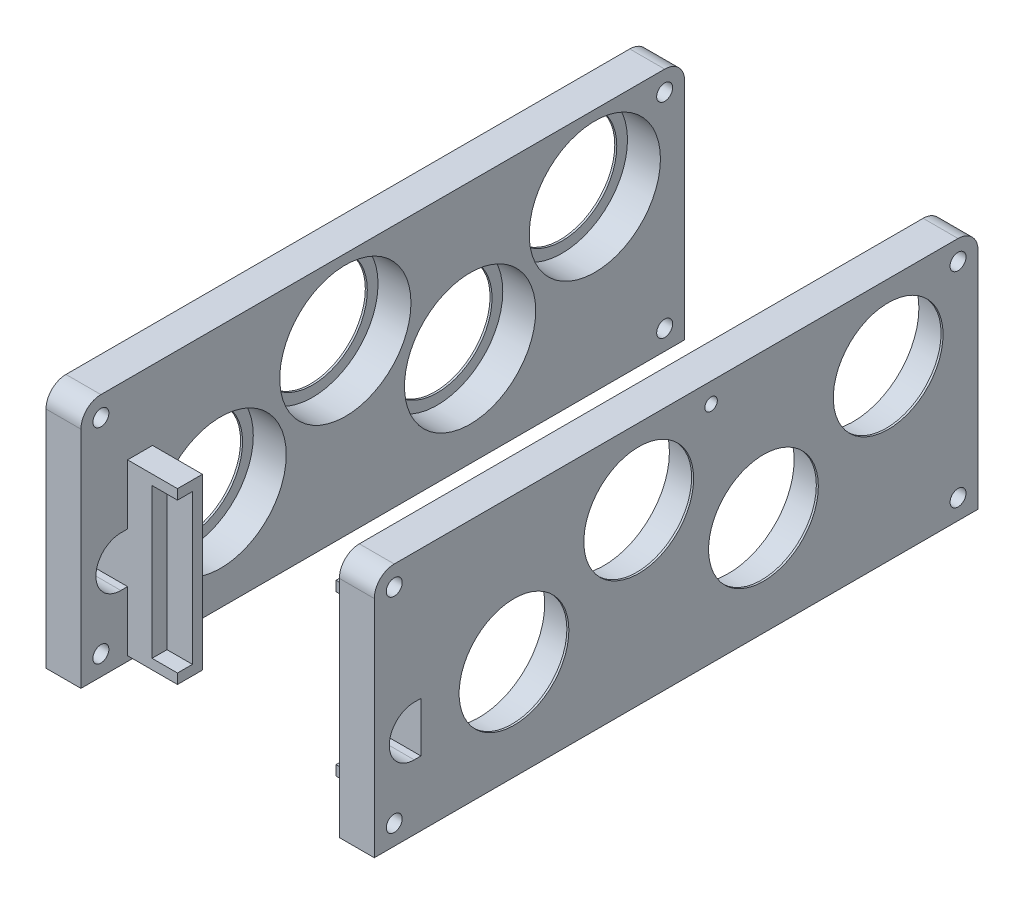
ISO-10303-21;
HEADER;
FILE_DESCRIPTION(('STEP AP214'),'2;1');
FILE_NAME('part.step','',(''),(''),'','','');
FILE_SCHEMA(('AUTOMOTIVE_DESIGN { 1 0 10303 214 1 1 1 1 }'));
ENDSEC;
DATA;
#1=APPLICATION_CONTEXT('core data for automotive mechanical design processes');
#2=APPLICATION_PROTOCOL_DEFINITION('international standard','automotive_design',2000,#1);
#3=PRODUCT_CONTEXT('',#1,'mechanical');
#4=PRODUCT('Part','Part','',(#3));
#5=PRODUCT_RELATED_PRODUCT_CATEGORY('part','',(#4));
#6=PRODUCT_DEFINITION_FORMATION('','',#4);
#7=PRODUCT_DEFINITION_CONTEXT('part definition',#1,'design');
#8=PRODUCT_DEFINITION('design','',#6,#7);
#9=PRODUCT_DEFINITION_SHAPE('','',#8);
#10=(LENGTH_UNIT() NAMED_UNIT(*) SI_UNIT(.MILLI.,.METRE.));
#11=(NAMED_UNIT(*) PLANE_ANGLE_UNIT() SI_UNIT($,.RADIAN.));
#12=(NAMED_UNIT(*) SI_UNIT($,.STERADIAN.) SOLID_ANGLE_UNIT());
#13=UNCERTAINTY_MEASURE_WITH_UNIT(LENGTH_MEASURE(1.E-05),#10,'distance_accuracy_value','');
#14=(GEOMETRIC_REPRESENTATION_CONTEXT(3) GLOBAL_UNCERTAINTY_ASSIGNED_CONTEXT((#13)) GLOBAL_UNIT_ASSIGNED_CONTEXT((#10,
#11,#12)) REPRESENTATION_CONTEXT('',''));
#15=CARTESIAN_POINT('',(0.,0.,0.));
#16=DIRECTION('',(0.,0.,1.));
#17=DIRECTION('',(1.,0.,0.));
#18=AXIS2_PLACEMENT_3D('',#15,#16,#17);
#19=CARTESIAN_POINT('',(-41.8,45.,-67.5));
#20=DIRECTION('',(-1.,0.,0.));
#21=DIRECTION('',(0.,0.,-1.));
#22=AXIS2_PLACEMENT_3D('',#19,#20,#21);
#23=CYLINDRICAL_SURFACE('',#22,1.25);
#24=CARTESIAN_POINT('',(-58.8,45.,-67.5));
#25=DIRECTION('',(1.,0.,0.));
#26=DIRECTION('',(0.,0.,-1.));
#27=AXIS2_PLACEMENT_3D('',#24,#25,#26);
#28=CIRCLE('',#27,1.25);
#29=CARTESIAN_POINT('',(-58.8,45.,-68.75));
#30=VERTEX_POINT('',#29);
#31=EDGE_CURVE('E856',#30,#30,#28,.T.);
#32=ORIENTED_EDGE('',*,*,#31,.F.);
#33=EDGE_LOOP('',(#32));
#34=FACE_BOUND('',#33,.T.);
#35=CARTESIAN_POINT('',(-52.3,45.,-67.5));
#36=DIRECTION('',(-1.,0.,0.));
#37=DIRECTION('',(0.,0.,1.));
#38=AXIS2_PLACEMENT_3D('',#35,#36,#37);
#39=CIRCLE('',#38,1.25);
#40=CARTESIAN_POINT('',(-52.3,45.,-66.25));
#41=VERTEX_POINT('',#40);
#42=EDGE_CURVE('E12',#41,#41,#39,.F.);
#43=ORIENTED_EDGE('',*,*,#42,.T.);
#44=EDGE_LOOP('',(#43));
#45=FACE_BOUND('',#44,.T.);
#46=ADVANCED_FACE('F53',(#34,#45),#23,.F.);
#47=CARTESIAN_POINT('',(-51.8,0.,0.));
#48=DIRECTION('',(1.,0.,0.));
#49=DIRECTION('',(0.,0.,1.));
#50=AXIS2_PLACEMENT_3D('',#47,#48,#49);
#51=PLANE('',#50);
#52=CARTESIAN_POINT('',(-51.8,4.00000000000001,-4.));
#53=DIRECTION('',(-1.,0.,0.));
#54=DIRECTION('',(0.,0.,1.));
#55=AXIS2_PLACEMENT_3D('',#52,#53,#54);
#56=CIRCLE('',#55,1.6);
#57=CARTESIAN_POINT('',(-51.8,4.00000000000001,-2.4));
#58=VERTEX_POINT('',#57);
#59=EDGE_CURVE('E214',#58,#58,#56,.T.);
#60=ORIENTED_EDGE('',*,*,#59,.T.);
#61=EDGE_LOOP('',(#60));
#62=FACE_BOUND('',#61,.T.);
#63=CARTESIAN_POINT('',(-51.8,4.,-117.));
#64=DIRECTION('',(-1.,0.,0.));
#65=DIRECTION('',(0.,0.,1.));
#66=AXIS2_PLACEMENT_3D('',#63,#64,#65);
#67=CIRCLE('',#66,1.60000000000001);
#68=CARTESIAN_POINT('',(-51.8,4.,-115.4));
#69=VERTEX_POINT('',#68);
#70=EDGE_CURVE('E873',#69,#69,#67,.T.);
#71=ORIENTED_EDGE('',*,*,#70,.T.);
#72=EDGE_LOOP('',(#71));
#73=FACE_BOUND('',#72,.T.);
#74=CARTESIAN_POINT('',(-51.8,45.,-117.));
#75=DIRECTION('',(-1.,0.,0.));
#76=DIRECTION('',(0.,0.,1.));
#77=AXIS2_PLACEMENT_3D('',#74,#75,#76);
#78=CIRCLE('',#77,1.60000000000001);
#79=CARTESIAN_POINT('',(-51.8,45.,-115.4));
#80=VERTEX_POINT('',#79);
#81=EDGE_CURVE('E850',#80,#80,#78,.T.);
#82=ORIENTED_EDGE('',*,*,#81,.T.);
#83=EDGE_LOOP('',(#82));
#84=FACE_BOUND('',#83,.T.);
#85=CARTESIAN_POINT('',(-51.8,45.,-4.));
#86=DIRECTION('',(-1.,0.,0.));
#87=DIRECTION('',(0.,0.,1.));
#88=AXIS2_PLACEMENT_3D('',#85,#86,#87);
#89=CIRCLE('',#88,1.6);
#90=CARTESIAN_POINT('',(-51.8,45.,-2.4));
#91=VERTEX_POINT('',#90);
#92=EDGE_CURVE('E859',#91,#91,#89,.T.);
#93=ORIENTED_EDGE('',*,*,#92,.T.);
#94=EDGE_LOOP('',(#93));
#95=FACE_BOUND('',#94,.T.);
#96=DIRECTION('',(0.,0.,-1.));
#97=VECTOR('',#96,1.);
#98=CARTESIAN_POINT('',(-51.8,23.,-9.35));
#99=LINE('',#98,#97);
#100=CARTESIAN_POINT('',(-51.8,23.,-8.));
#101=VERTEX_POINT('',#100);
#102=CARTESIAN_POINT('',(-51.8,23.,-9.34999999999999));
#103=VERTEX_POINT('',#102);
#104=EDGE_CURVE('E201',#101,#103,#99,.T.);
#105=ORIENTED_EDGE('',*,*,#104,.T.);
#106=DIRECTION('',(0.,1.,0.));
#107=VECTOR('',#106,1.);
#108=CARTESIAN_POINT('',(-51.8,3.,-9.34999999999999));
#109=LINE('',#108,#107);
#110=CARTESIAN_POINT('',(-51.8,35.,-9.35));
#111=VERTEX_POINT('',#110);
#112=EDGE_CURVE('E232',#103,#111,#109,.T.);
#113=ORIENTED_EDGE('',*,*,#112,.T.);
#114=DIRECTION('',(0.,0.,-1.));
#115=VECTOR('',#114,1.);
#116=CARTESIAN_POINT('',(-51.8,35.,-14.35));
#117=LINE('',#116,#115);
#118=CARTESIAN_POINT('',(-51.8,35.,-14.35));
#119=VERTEX_POINT('',#118);
#120=EDGE_CURVE('E259',#111,#119,#117,.T.);
#121=ORIENTED_EDGE('',*,*,#120,.T.);
#122=DIRECTION('',(0.,-1.,0.));
#123=VECTOR('',#122,1.);
#124=CARTESIAN_POINT('',(-51.8,1.,-14.35));
#125=LINE('',#124,#123);
#126=CARTESIAN_POINT('',(-51.8,1.,-14.35));
#127=VERTEX_POINT('',#126);
#128=EDGE_CURVE('E262',#119,#127,#125,.T.);
#129=ORIENTED_EDGE('',*,*,#128,.T.);
#130=DIRECTION('',(0.,0.,1.));
#131=VECTOR('',#130,1.);
#132=CARTESIAN_POINT('',(-51.8,1.,-9.34999999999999));
#133=LINE('',#132,#131);
#134=CARTESIAN_POINT('',(-51.8,1.,-9.34999999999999));
#135=VERTEX_POINT('',#134);
#136=EDGE_CURVE('E236',#127,#135,#133,.T.);
#137=ORIENTED_EDGE('',*,*,#136,.T.);
#138=CARTESIAN_POINT('',(-51.8,13.,-9.34999999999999));
#139=VERTEX_POINT('',#138);
#140=EDGE_CURVE('E257',#135,#139,#109,.T.);
#141=ORIENTED_EDGE('',*,*,#140,.T.);
#142=DIRECTION('',(0.,0.,1.));
#143=VECTOR('',#142,1.);
#144=CARTESIAN_POINT('',(-51.8,13.,-9.34999999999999));
#145=LINE('',#144,#143);
#146=CARTESIAN_POINT('',(-51.8,13.,-8.));
#147=VERTEX_POINT('',#146);
#148=EDGE_CURVE('E186',#139,#147,#145,.T.);
#149=ORIENTED_EDGE('',*,*,#148,.T.);
#150=CARTESIAN_POINT('',(-51.8,18.,-8.));
#151=DIRECTION('',(-1.,0.,0.));
#152=DIRECTION('',(0.,0.,-1.));
#153=AXIS2_PLACEMENT_3D('',#150,#151,#152);
#154=CIRCLE('',#153,5.);
#155=EDGE_CURVE('E213',#147,#101,#154,.T.);
#156=ORIENTED_EDGE('',*,*,#155,.T.);
#157=EDGE_LOOP('',(#105,#113,#121,#129,#137,#141,#149,#156));
#158=FACE_BOUND('',#157,.T.);
#159=CARTESIAN_POINT('',(-51.8,33.85,-53.));
#160=DIRECTION('',(1.,0.,0.));
#161=DIRECTION('',(0.,0.,-1.));
#162=AXIS2_PLACEMENT_3D('',#159,#160,#161);
#163=CIRCLE('',#162,13.15);
#164=CARTESIAN_POINT('',(-51.8,33.85,-66.15));
#165=VERTEX_POINT('',#164);
#166=EDGE_CURVE('E323',#165,#165,#163,.T.);
#167=ORIENTED_EDGE('',*,*,#166,.F.);
#168=EDGE_LOOP('',(#167));
#169=FACE_BOUND('',#168,.T.);
#170=CARTESIAN_POINT('',(-51.8,20.,-78.));
#171=DIRECTION('',(1.,0.,0.));
#172=DIRECTION('',(0.,0.,-1.));
#173=AXIS2_PLACEMENT_3D('',#170,#171,#172);
#174=CIRCLE('',#173,13.15);
#175=CARTESIAN_POINT('',(-51.8,20.,-91.15));
#176=VERTEX_POINT('',#175);
#177=EDGE_CURVE('E329',#176,#176,#174,.T.);
#178=ORIENTED_EDGE('',*,*,#177,.F.);
#179=EDGE_LOOP('',(#178));
#180=FACE_BOUND('',#179,.T.);
#181=DIRECTION('',(0.,0.,1.));
#182=VECTOR('',#181,1.);
#183=CARTESIAN_POINT('',(-51.8,49.,0.));
#184=LINE('',#183,#182);
#185=CARTESIAN_POINT('',(-51.8,49.,-117.));
#186=VERTEX_POINT('',#185);
#187=CARTESIAN_POINT('',(-51.8,49.,-4.));
#188=VERTEX_POINT('',#187);
#189=EDGE_CURVE('E336',#186,#188,#184,.T.);
#190=ORIENTED_EDGE('',*,*,#189,.T.);
#191=CARTESIAN_POINT('',(-51.8,45.,-4.));
#192=DIRECTION('',(-1.,0.,0.));
#193=DIRECTION('',(0.,0.,1.));
#194=AXIS2_PLACEMENT_3D('',#191,#192,#193);
#195=CIRCLE('',#194,4.);
#196=CARTESIAN_POINT('',(-51.8,45.,0.));
#197=VERTEX_POINT('',#196);
#198=EDGE_CURVE('E365',#197,#188,#195,.T.);
#199=ORIENTED_EDGE('',*,*,#198,.F.);
#200=DIRECTION('',(0.,-1.,0.));
#201=VECTOR('',#200,1.);
#202=CARTESIAN_POINT('',(-51.8,0.,0.));
#203=LINE('',#202,#201);
#204=CARTESIAN_POINT('',(-51.8,0.,0.));
#205=VERTEX_POINT('',#204);
#206=EDGE_CURVE('E332',#197,#205,#203,.T.);
#207=ORIENTED_EDGE('',*,*,#206,.T.);
#208=DIRECTION('',(0.,0.,-1.));
#209=VECTOR('',#208,1.);
#210=CARTESIAN_POINT('',(-51.8,0.,0.));
#211=LINE('',#210,#209);
#212=CARTESIAN_POINT('',(-51.8,0.,-121.));
#213=VERTEX_POINT('',#212);
#214=EDGE_CURVE('E348',#205,#213,#211,.T.);
#215=ORIENTED_EDGE('',*,*,#214,.T.);
#216=DIRECTION('',(0.,1.,0.));
#217=VECTOR('',#216,1.);
#218=CARTESIAN_POINT('',(-51.8,0.,-121.));
#219=LINE('',#218,#217);
#220=CARTESIAN_POINT('',(-51.8,45.,-121.));
#221=VERTEX_POINT('',#220);
#222=EDGE_CURVE('E351',#213,#221,#219,.T.);
#223=ORIENTED_EDGE('',*,*,#222,.T.);
#224=CARTESIAN_POINT('',(-51.8,45.,-117.));
#225=DIRECTION('',(-1.,0.,0.));
#226=DIRECTION('',(0.,0.,1.));
#227=AXIS2_PLACEMENT_3D('',#224,#225,#226);
#228=CIRCLE('',#227,4.);
#229=EDGE_CURVE('E368',#186,#221,#228,.T.);
#230=ORIENTED_EDGE('',*,*,#229,.F.);
#231=EDGE_LOOP('',(#190,#199,#207,#215,#223,#230));
#232=FACE_BOUND('',#231,.T.);
#233=CARTESIAN_POINT('',(-51.8,20.,-28.));
#234=DIRECTION('',(1.,0.,0.));
#235=DIRECTION('',(0.,0.,-1.));
#236=AXIS2_PLACEMENT_3D('',#233,#234,#235);
#237=CIRCLE('',#236,13.15);
#238=CARTESIAN_POINT('',(-51.8,20.,-41.15));
#239=VERTEX_POINT('',#238);
#240=EDGE_CURVE('E326',#239,#239,#237,.T.);
#241=ORIENTED_EDGE('',*,*,#240,.F.);
#242=EDGE_LOOP('',(#241));
#243=FACE_BOUND('',#242,.T.);
#244=CARTESIAN_POINT('',(-51.8,33.85,-103.));
#245=DIRECTION('',(1.,0.,0.));
#246=DIRECTION('',(0.,0.,-1.));
#247=AXIS2_PLACEMENT_3D('',#244,#245,#246);
#248=CIRCLE('',#247,13.15);
#249=CARTESIAN_POINT('',(-51.8,33.85,-116.15));
#250=VERTEX_POINT('',#249);
#251=EDGE_CURVE('E320',#250,#250,#248,.T.);
#252=ORIENTED_EDGE('',*,*,#251,.F.);
#253=EDGE_LOOP('',(#252));
#254=FACE_BOUND('',#253,.T.);
#255=ADVANCED_FACE('F381',(#62,#73,#84,#95,#158,#169,#180,#232,#243,#254),#51,.T.);
#256=CARTESIAN_POINT('',(-41.8,3.,-9.34999999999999));
#257=DIRECTION('',(0.,-1.,0.));
#258=DIRECTION('',(0.,0.,-1.));
#259=AXIS2_PLACEMENT_3D('',#256,#257,#258);
#260=PLANE('',#259);
#261=DIRECTION('',(0.,0.,1.));
#262=VECTOR('',#261,1.);
#263=CARTESIAN_POINT('',(-46.9,3.,-9.34999999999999));
#264=LINE('',#263,#262);
#265=CARTESIAN_POINT('',(-46.9,3.,-12.35));
#266=VERTEX_POINT('',#265);
#267=CARTESIAN_POINT('',(-46.9,3.,-9.34999999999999));
#268=VERTEX_POINT('',#267);
#269=EDGE_CURVE('E229',#266,#268,#264,.T.);
#270=ORIENTED_EDGE('',*,*,#269,.T.);
#271=DIRECTION('',(-1.,0.,0.));
#272=VECTOR('',#271,1.);
#273=CARTESIAN_POINT('',(-41.8,3.,-9.34999999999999));
#274=LINE('',#273,#272);
#275=CARTESIAN_POINT('',(-41.8,3.,-9.34999999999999));
#276=VERTEX_POINT('',#275);
#277=EDGE_CURVE('E283',#276,#268,#274,.T.);
#278=ORIENTED_EDGE('',*,*,#277,.F.);
#279=DIRECTION('',(0.,0.,-1.));
#280=VECTOR('',#279,1.);
#281=CARTESIAN_POINT('',(-41.8,3.,-9.34999999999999));
#282=LINE('',#281,#280);
#283=CARTESIAN_POINT('',(-41.8,3.,-12.35));
#284=VERTEX_POINT('',#283);
#285=EDGE_CURVE('E235',#276,#284,#282,.T.);
#286=ORIENTED_EDGE('',*,*,#285,.T.);
#287=DIRECTION('',(-1.,0.,0.));
#288=VECTOR('',#287,1.);
#289=CARTESIAN_POINT('',(-41.8,3.,-12.35));
#290=LINE('',#289,#288);
#291=EDGE_CURVE('E280',#284,#266,#290,.T.);
#292=ORIENTED_EDGE('',*,*,#291,.T.);
#293=EDGE_LOOP('',(#270,#278,#286,#292));
#294=FACE_BOUND('',#293,.T.);
#295=ADVANCED_FACE('F412',(#294),#260,.F.);
#296=CARTESIAN_POINT('',(-41.8,3.,-12.35));
#297=DIRECTION('',(0.,0.,-1.));
#298=DIRECTION('',(1.,0.,0.));
#299=AXIS2_PLACEMENT_3D('',#296,#297,#298);
#300=PLANE('',#299);
#301=DIRECTION('',(0.,-1.,0.));
#302=VECTOR('',#301,1.);
#303=CARTESIAN_POINT('',(-46.9,33.,-12.35));
#304=LINE('',#303,#302);
#305=CARTESIAN_POINT('',(-46.9,33.,-12.35));
#306=VERTEX_POINT('',#305);
#307=EDGE_CURVE('E227',#306,#266,#304,.T.);
#308=ORIENTED_EDGE('',*,*,#307,.T.);
#309=ORIENTED_EDGE('',*,*,#291,.F.);
#310=DIRECTION('',(0.,1.,0.));
#311=VECTOR('',#310,1.);
#312=CARTESIAN_POINT('',(-41.8,3.,-12.35));
#313=LINE('',#312,#311);
#314=CARTESIAN_POINT('',(-41.8,33.,-12.35));
#315=VERTEX_POINT('',#314);
#316=EDGE_CURVE('E239',#284,#315,#313,.T.);
#317=ORIENTED_EDGE('',*,*,#316,.T.);
#318=DIRECTION('',(-1.,0.,0.));
#319=VECTOR('',#318,1.);
#320=CARTESIAN_POINT('',(-41.8,33.,-12.35));
#321=LINE('',#320,#319);
#322=EDGE_CURVE('E277',#315,#306,#321,.T.);
#323=ORIENTED_EDGE('',*,*,#322,.T.);
#324=EDGE_LOOP('',(#308,#309,#317,#323));
#325=FACE_BOUND('',#324,.T.);
#326=ADVANCED_FACE('F464',(#325),#300,.F.);
#327=CARTESIAN_POINT('',(-41.8,33.,-9.35));
#328=DIRECTION('',(0.,1.,0.));
#329=DIRECTION('',(0.,0.,1.));
#330=AXIS2_PLACEMENT_3D('',#327,#328,#329);
#331=PLANE('',#330);
#332=DIRECTION('',(0.,0.,-1.));
#333=VECTOR('',#332,1.);
#334=CARTESIAN_POINT('',(-46.9,33.,-9.35));
#335=LINE('',#334,#333);
#336=CARTESIAN_POINT('',(-46.9,33.,-9.35));
#337=VERTEX_POINT('',#336);
#338=EDGE_CURVE('E225',#337,#306,#335,.T.);
#339=ORIENTED_EDGE('',*,*,#338,.T.);
#340=ORIENTED_EDGE('',*,*,#322,.F.);
#341=DIRECTION('',(0.,0.,1.));
#342=VECTOR('',#341,1.);
#343=CARTESIAN_POINT('',(-41.8,33.,-9.35));
#344=LINE('',#343,#342);
#345=CARTESIAN_POINT('',(-41.8,33.,-9.35));
#346=VERTEX_POINT('',#345);
#347=EDGE_CURVE('E242',#315,#346,#344,.T.);
#348=ORIENTED_EDGE('',*,*,#347,.T.);
#349=DIRECTION('',(-1.,0.,0.));
#350=VECTOR('',#349,1.);
#351=CARTESIAN_POINT('',(-41.8,33.,-9.35));
#352=LINE('',#351,#350);
#353=EDGE_CURVE('E274',#346,#337,#352,.T.);
#354=ORIENTED_EDGE('',*,*,#353,.T.);
#355=EDGE_LOOP('',(#339,#340,#348,#354));
#356=FACE_BOUND('',#355,.T.);
#357=ADVANCED_FACE('F460',(#356),#331,.F.);
#358=CARTESIAN_POINT('',(-58.8,20.,-78.));
#359=DIRECTION('',(1.,0.,0.));
#360=DIRECTION('',(0.,0.,1.));
#361=AXIS2_PLACEMENT_3D('',#358,#359,#360);
#362=CYLINDRICAL_SURFACE('',#361,13.15);
#363=ORIENTED_EDGE('',*,*,#177,.T.);
#364=EDGE_LOOP('',(#363));
#365=FACE_BOUND('',#364,.T.);
#366=CARTESIAN_POINT('',(-58.4,20.,-78.));
#367=DIRECTION('',(1.,0.,0.));
#368=DIRECTION('',(0.,0.,-1.));
#369=AXIS2_PLACEMENT_3D('',#366,#367,#368);
#370=CIRCLE('',#369,13.15);
#371=CARTESIAN_POINT('',(-58.4,20.,-91.15));
#372=VERTEX_POINT('',#371);
#373=EDGE_CURVE('E317',#372,#372,#370,.T.);
#374=ORIENTED_EDGE('',*,*,#373,.F.);
#375=EDGE_LOOP('',(#374));
#376=FACE_BOUND('',#375,.T.);
#377=ADVANCED_FACE('F463',(#365,#376),#362,.F.);
#378=CARTESIAN_POINT('',(-58.8,20.,-28.));
#379=DIRECTION('',(1.,0.,0.));
#380=DIRECTION('',(0.,0.,1.));
#381=AXIS2_PLACEMENT_3D('',#378,#379,#380);
#382=CYLINDRICAL_SURFACE('',#381,13.15);
#383=ORIENTED_EDGE('',*,*,#240,.T.);
#384=EDGE_LOOP('',(#383));
#385=FACE_BOUND('',#384,.T.);
#386=CARTESIAN_POINT('',(-58.4,20.,-28.));
#387=DIRECTION('',(1.,0.,0.));
#388=DIRECTION('',(0.,0.,-1.));
#389=AXIS2_PLACEMENT_3D('',#386,#387,#388);
#390=CIRCLE('',#389,13.15);
#391=CARTESIAN_POINT('',(-58.4,20.,-41.15));
#392=VERTEX_POINT('',#391);
#393=EDGE_CURVE('E314',#392,#392,#390,.T.);
#394=ORIENTED_EDGE('',*,*,#393,.F.);
#395=EDGE_LOOP('',(#394));
#396=FACE_BOUND('',#395,.T.);
#397=ADVANCED_FACE('F504',(#385,#396),#382,.F.);
#398=CARTESIAN_POINT('',(-58.8,33.85,-53.));
#399=DIRECTION('',(1.,0.,0.));
#400=DIRECTION('',(0.,0.,1.));
#401=AXIS2_PLACEMENT_3D('',#398,#399,#400);
#402=CYLINDRICAL_SURFACE('',#401,13.15);
#403=ORIENTED_EDGE('',*,*,#166,.T.);
#404=EDGE_LOOP('',(#403));
#405=FACE_BOUND('',#404,.T.);
#406=CARTESIAN_POINT('',(-58.4,33.85,-53.));
#407=DIRECTION('',(1.,0.,0.));
#408=DIRECTION('',(0.,0.,-1.));
#409=AXIS2_PLACEMENT_3D('',#406,#407,#408);
#410=CIRCLE('',#409,13.15);
#411=CARTESIAN_POINT('',(-58.4,33.85,-66.15));
#412=VERTEX_POINT('',#411);
#413=EDGE_CURVE('E311',#412,#412,#410,.T.);
#414=ORIENTED_EDGE('',*,*,#413,.F.);
#415=EDGE_LOOP('',(#414));
#416=FACE_BOUND('',#415,.T.);
#417=ADVANCED_FACE('F500',(#405,#416),#402,.F.);
#418=CARTESIAN_POINT('',(-58.8,33.85,-103.));
#419=DIRECTION('',(1.,0.,0.));
#420=DIRECTION('',(0.,0.,1.));
#421=AXIS2_PLACEMENT_3D('',#418,#419,#420);
#422=CYLINDRICAL_SURFACE('',#421,13.15);
#423=ORIENTED_EDGE('',*,*,#251,.T.);
#424=EDGE_LOOP('',(#423));
#425=FACE_BOUND('',#424,.T.);
#426=CARTESIAN_POINT('',(-58.4,33.85,-103.));
#427=DIRECTION('',(1.,0.,0.));
#428=DIRECTION('',(0.,0.,-1.));
#429=AXIS2_PLACEMENT_3D('',#426,#427,#428);
#430=CIRCLE('',#429,13.15);
#431=CARTESIAN_POINT('',(-58.4,33.85,-116.15));
#432=VERTEX_POINT('',#431);
#433=EDGE_CURVE('E308',#432,#432,#430,.T.);
#434=ORIENTED_EDGE('',*,*,#433,.F.);
#435=EDGE_LOOP('',(#434));
#436=FACE_BOUND('',#435,.T.);
#437=ADVANCED_FACE('F497',(#425,#436),#422,.F.);
#438=CARTESIAN_POINT('',(-58.8,0.,0.));
#439=DIRECTION('',(1.,0.,0.));
#440=DIRECTION('',(0.,0.,1.));
#441=AXIS2_PLACEMENT_3D('',#438,#439,#440);
#442=PLANE('',#441);
#443=CARTESIAN_POINT('',(-58.8,4.00000000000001,-4.));
#444=DIRECTION('',(1.,0.,0.));
#445=DIRECTION('',(0.,0.,1.));
#446=AXIS2_PLACEMENT_3D('',#443,#444,#445);
#447=CIRCLE('',#446,1.6);
#448=CARTESIAN_POINT('',(-58.8,4.00000000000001,-2.4));
#449=VERTEX_POINT('',#448);
#450=EDGE_CURVE('E867',#449,#449,#447,.T.);
#451=ORIENTED_EDGE('',*,*,#450,.T.);
#452=EDGE_LOOP('',(#451));
#453=FACE_BOUND('',#452,.T.);
#454=CARTESIAN_POINT('',(-58.8,4.,-117.));
#455=DIRECTION('',(1.,0.,0.));
#456=DIRECTION('',(0.,0.,1.));
#457=AXIS2_PLACEMENT_3D('',#454,#455,#456);
#458=CIRCLE('',#457,1.60000000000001);
#459=CARTESIAN_POINT('',(-58.8,4.,-115.4));
#460=VERTEX_POINT('',#459);
#461=EDGE_CURVE('E862',#460,#460,#458,.T.);
#462=ORIENTED_EDGE('',*,*,#461,.T.);
#463=EDGE_LOOP('',(#462));
#464=FACE_BOUND('',#463,.T.);
#465=ORIENTED_EDGE('',*,*,#31,.T.);
#466=EDGE_LOOP('',(#465));
#467=FACE_BOUND('',#466,.T.);
#468=CARTESIAN_POINT('',(-58.8,45.,-117.));
#469=DIRECTION('',(1.,0.,0.));
#470=DIRECTION('',(0.,0.,-1.));
#471=AXIS2_PLACEMENT_3D('',#468,#469,#470);
#472=CIRCLE('',#471,1.60000000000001);
#473=CARTESIAN_POINT('',(-58.8,45.,-118.6));
#474=VERTEX_POINT('',#473);
#475=EDGE_CURVE('E853',#474,#474,#472,.T.);
#476=ORIENTED_EDGE('',*,*,#475,.T.);
#477=EDGE_LOOP('',(#476));
#478=FACE_BOUND('',#477,.T.);
#479=CARTESIAN_POINT('',(-58.8,45.,-4.));
#480=DIRECTION('',(1.,0.,0.));
#481=DIRECTION('',(0.,0.,-1.));
#482=AXIS2_PLACEMENT_3D('',#479,#480,#481);
#483=CIRCLE('',#482,1.6);
#484=CARTESIAN_POINT('',(-58.8,45.,-5.6));
#485=VERTEX_POINT('',#484);
#486=EDGE_CURVE('E855',#485,#485,#483,.T.);
#487=ORIENTED_EDGE('',*,*,#486,.T.);
#488=EDGE_LOOP('',(#487));
#489=FACE_BOUND('',#488,.T.);
#490=DIRECTION('',(0.,0.,-1.));
#491=VECTOR('',#490,1.);
#492=CARTESIAN_POINT('',(-58.8,23.,-9.35));
#493=LINE('',#492,#491);
#494=CARTESIAN_POINT('',(-58.8,23.,-8.));
#495=VERTEX_POINT('',#494);
#496=CARTESIAN_POINT('',(-58.8,23.,-9.35));
#497=VERTEX_POINT('',#496);
#498=EDGE_CURVE('E191',#495,#497,#493,.T.);
#499=ORIENTED_EDGE('',*,*,#498,.F.);
#500=CARTESIAN_POINT('',(-58.8,18.,-8.));
#501=DIRECTION('',(-1.,0.,0.));
#502=DIRECTION('',(0.,0.,-1.));
#503=AXIS2_PLACEMENT_3D('',#500,#501,#502);
#504=CIRCLE('',#503,5.);
#505=CARTESIAN_POINT('',(-58.8,13.,-8.));
#506=VERTEX_POINT('',#505);
#507=EDGE_CURVE('E206',#506,#495,#504,.T.);
#508=ORIENTED_EDGE('',*,*,#507,.F.);
#509=DIRECTION('',(0.,0.,1.));
#510=VECTOR('',#509,1.);
#511=CARTESIAN_POINT('',(-58.8,13.,-9.34999999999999));
#512=LINE('',#511,#510);
#513=CARTESIAN_POINT('',(-58.8,13.,-9.34999999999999));
#514=VERTEX_POINT('',#513);
#515=EDGE_CURVE('E183',#514,#506,#512,.T.);
#516=ORIENTED_EDGE('',*,*,#515,.F.);
#517=DIRECTION('',(0.,-1.,0.));
#518=VECTOR('',#517,1.);
#519=CARTESIAN_POINT('',(-58.8,23.,-9.35));
#520=LINE('',#519,#518);
#521=EDGE_CURVE('E194',#497,#514,#520,.T.);
#522=ORIENTED_EDGE('',*,*,#521,.F.);
#523=EDGE_LOOP('',(#499,#508,#516,#522));
#524=FACE_BOUND('',#523,.T.);
#525=DIRECTION('',(0.,1.,0.));
#526=VECTOR('',#525,1.);
#527=CARTESIAN_POINT('',(-58.8,0.,-121.));
#528=LINE('',#527,#526);
#529=CARTESIAN_POINT('',(-58.8,0.,-121.));
#530=VERTEX_POINT('',#529);
#531=CARTESIAN_POINT('',(-58.8,45.,-121.));
#532=VERTEX_POINT('',#531);
#533=EDGE_CURVE('E339',#530,#532,#528,.T.);
#534=ORIENTED_EDGE('',*,*,#533,.F.);
#535=DIRECTION('',(0.,0.,-1.));
#536=VECTOR('',#535,1.);
#537=CARTESIAN_POINT('',(-58.8,0.,0.));
#538=LINE('',#537,#536);
#539=CARTESIAN_POINT('',(-58.8,0.,0.));
#540=VERTEX_POINT('',#539);
#541=EDGE_CURVE('E335',#540,#530,#538,.T.);
#542=ORIENTED_EDGE('',*,*,#541,.F.);
#543=DIRECTION('',(0.,-1.,0.));
#544=VECTOR('',#543,1.);
#545=CARTESIAN_POINT('',(-58.8,0.,0.));
#546=LINE('',#545,#544);
#547=CARTESIAN_POINT('',(-58.8,45.,0.));
#548=VERTEX_POINT('',#547);
#549=EDGE_CURVE('E333',#548,#540,#546,.T.);
#550=ORIENTED_EDGE('',*,*,#549,.F.);
#551=CARTESIAN_POINT('',(-58.8,45.,-4.));
#552=DIRECTION('',(-1.,0.,0.));
#553=DIRECTION('',(0.,0.,1.));
#554=AXIS2_PLACEMENT_3D('',#551,#552,#553);
#555=CIRCLE('',#554,4.);
#556=CARTESIAN_POINT('',(-58.8,49.,-4.));
#557=VERTEX_POINT('',#556);
#558=EDGE_CURVE('E371',#557,#548,#555,.F.);
#559=ORIENTED_EDGE('',*,*,#558,.F.);
#560=DIRECTION('',(0.,0.,1.));
#561=VECTOR('',#560,1.);
#562=CARTESIAN_POINT('',(-58.8,49.,0.));
#563=LINE('',#562,#561);
#564=CARTESIAN_POINT('',(-58.8,49.,-117.));
#565=VERTEX_POINT('',#564);
#566=EDGE_CURVE('E342',#565,#557,#563,.T.);
#567=ORIENTED_EDGE('',*,*,#566,.F.);
#568=CARTESIAN_POINT('',(-58.8,45.,-117.));
#569=DIRECTION('',(-1.,0.,0.));
#570=DIRECTION('',(0.,0.,1.));
#571=AXIS2_PLACEMENT_3D('',#568,#569,#570);
#572=CIRCLE('',#571,4.);
#573=EDGE_CURVE('E373',#532,#565,#572,.F.);
#574=ORIENTED_EDGE('',*,*,#573,.F.);
#575=EDGE_LOOP('',(#534,#542,#550,#559,#567,#574));
#576=FACE_BOUND('',#575,.T.);
#577=CARTESIAN_POINT('',(-58.8,33.85,-103.));
#578=DIRECTION('',(1.,0.,0.));
#579=DIRECTION('',(0.,0.,-1.));
#580=AXIS2_PLACEMENT_3D('',#577,#578,#579);
#581=CIRCLE('',#580,11.);
#582=CARTESIAN_POINT('',(-58.8,33.85,-114.));
#583=VERTEX_POINT('',#582);
#584=EDGE_CURVE('E286',#583,#583,#581,.T.);
#585=ORIENTED_EDGE('',*,*,#584,.T.);
#586=EDGE_LOOP('',(#585));
#587=FACE_BOUND('',#586,.T.);
#588=CARTESIAN_POINT('',(-58.8,33.85,-53.));
#589=DIRECTION('',(1.,0.,0.));
#590=DIRECTION('',(0.,0.,-1.));
#591=AXIS2_PLACEMENT_3D('',#588,#589,#590);
#592=CIRCLE('',#591,11.);
#593=CARTESIAN_POINT('',(-58.8,33.85,-64.));
#594=VERTEX_POINT('',#593);
#595=EDGE_CURVE('E296',#594,#594,#592,.T.);
#596=ORIENTED_EDGE('',*,*,#595,.T.);
#597=EDGE_LOOP('',(#596));
#598=FACE_BOUND('',#597,.T.);
#599=CARTESIAN_POINT('',(-58.8,20.,-28.));
#600=DIRECTION('',(1.,0.,0.));
#601=DIRECTION('',(0.,0.,-1.));
#602=AXIS2_PLACEMENT_3D('',#599,#600,#601);
#603=CIRCLE('',#602,11.);
#604=CARTESIAN_POINT('',(-58.8,20.,-39.));
#605=VERTEX_POINT('',#604);
#606=EDGE_CURVE('E302',#605,#605,#603,.T.);
#607=ORIENTED_EDGE('',*,*,#606,.T.);
#608=EDGE_LOOP('',(#607));
#609=FACE_BOUND('',#608,.T.);
#610=CARTESIAN_POINT('',(-58.8,20.,-78.));
#611=DIRECTION('',(1.,0.,0.));
#612=DIRECTION('',(0.,0.,-1.));
#613=AXIS2_PLACEMENT_3D('',#610,#611,#612);
#614=CIRCLE('',#613,11.);
#615=CARTESIAN_POINT('',(-58.8,20.,-89.));
#616=VERTEX_POINT('',#615);
#617=EDGE_CURVE('E290',#616,#616,#614,.T.);
#618=ORIENTED_EDGE('',*,*,#617,.T.);
#619=EDGE_LOOP('',(#618));
#620=FACE_BOUND('',#619,.T.);
#621=ADVANCED_FACE('F203',(#453,#464,#467,#478,#489,#524,#576,#587,#598,#609,#620),#442,.F.);
#622=CARTESIAN_POINT('',(-58.8,0.,0.));
#623=DIRECTION('',(0.,0.,-1.));
#624=DIRECTION('',(1.,0.,0.));
#625=AXIS2_PLACEMENT_3D('',#622,#623,#624);
#626=PLANE('',#625);
#627=ORIENTED_EDGE('',*,*,#549,.T.);
#628=DIRECTION('',(1.,0.,0.));
#629=VECTOR('',#628,1.);
#630=CARTESIAN_POINT('',(-58.8,0.,0.));
#631=LINE('',#630,#629);
#632=EDGE_CURVE('E357',#540,#205,#631,.T.);
#633=ORIENTED_EDGE('',*,*,#632,.T.);
#634=ORIENTED_EDGE('',*,*,#206,.F.);
#635=DIRECTION('',(1.,0.,0.));
#636=VECTOR('',#635,1.);
#637=CARTESIAN_POINT('',(-58.8,45.,0.));
#638=LINE('',#637,#636);
#639=EDGE_CURVE('E61',#548,#197,#638,.T.);
#640=ORIENTED_EDGE('',*,*,#639,.F.);
#641=EDGE_LOOP('',(#627,#633,#634,#640));
#642=FACE_BOUND('',#641,.T.);
#643=ADVANCED_FACE('F378',(#642),#626,.F.);
#644=CARTESIAN_POINT('',(-58.8,0.,0.));
#645=DIRECTION('',(0.,1.,0.));
#646=DIRECTION('',(0.,0.,1.));
#647=AXIS2_PLACEMENT_3D('',#644,#645,#646);
#648=PLANE('',#647);
#649=ORIENTED_EDGE('',*,*,#632,.F.);
#650=ORIENTED_EDGE('',*,*,#541,.T.);
#651=DIRECTION('',(1.,0.,0.));
#652=VECTOR('',#651,1.);
#653=CARTESIAN_POINT('',(-58.8,0.,-121.));
#654=LINE('',#653,#652);
#655=EDGE_CURVE('E345',#530,#213,#654,.T.);
#656=ORIENTED_EDGE('',*,*,#655,.T.);
#657=ORIENTED_EDGE('',*,*,#214,.F.);
#658=EDGE_LOOP('',(#649,#650,#656,#657));
#659=FACE_BOUND('',#658,.T.);
#660=ADVANCED_FACE('F392',(#659),#648,.F.);
#661=CARTESIAN_POINT('',(-58.8,0.,-121.));
#662=DIRECTION('',(0.,0.,1.));
#663=DIRECTION('',(-1.,0.,0.));
#664=AXIS2_PLACEMENT_3D('',#661,#662,#663);
#665=PLANE('',#664);
#666=ORIENTED_EDGE('',*,*,#222,.F.);
#667=ORIENTED_EDGE('',*,*,#655,.F.);
#668=ORIENTED_EDGE('',*,*,#533,.T.);
#669=DIRECTION('',(1.,0.,0.));
#670=VECTOR('',#669,1.);
#671=CARTESIAN_POINT('',(-58.8,45.,-121.));
#672=LINE('',#671,#670);
#673=EDGE_CURVE('E75',#221,#532,#672,.F.);
#674=ORIENTED_EDGE('',*,*,#673,.F.);
#675=EDGE_LOOP('',(#666,#667,#668,#674));
#676=FACE_BOUND('',#675,.T.);
#677=ADVANCED_FACE('F395',(#676),#665,.F.);
#678=CARTESIAN_POINT('',(-58.8,49.,0.));
#679=DIRECTION('',(0.,-1.,0.));
#680=DIRECTION('',(0.,0.,-1.));
#681=AXIS2_PLACEMENT_3D('',#678,#679,#680);
#682=PLANE('',#681);
#683=ORIENTED_EDGE('',*,*,#566,.T.);
#684=DIRECTION('',(1.,0.,0.));
#685=VECTOR('',#684,1.);
#686=CARTESIAN_POINT('',(-58.8,49.,-4.));
#687=LINE('',#686,#685);
#688=EDGE_CURVE('E359',#188,#557,#687,.F.);
#689=ORIENTED_EDGE('',*,*,#688,.F.);
#690=ORIENTED_EDGE('',*,*,#189,.F.);
#691=DIRECTION('',(1.,0.,0.));
#692=VECTOR('',#691,1.);
#693=CARTESIAN_POINT('',(-58.8,49.,-117.));
#694=LINE('',#693,#692);
#695=EDGE_CURVE('E363',#565,#186,#694,.T.);
#696=ORIENTED_EDGE('',*,*,#695,.F.);
#697=EDGE_LOOP('',(#683,#689,#690,#696));
#698=FACE_BOUND('',#697,.T.);
#699=ADVANCED_FACE('F386',(#698),#682,.F.);
#700=CARTESIAN_POINT('',(-58.4,0.,0.));
#701=DIRECTION('',(-1.,0.,0.));
#702=DIRECTION('',(0.,0.,-1.));
#703=AXIS2_PLACEMENT_3D('',#700,#701,#702);
#704=PLANE('',#703);
#705=CARTESIAN_POINT('',(-58.4,33.85,-103.));
#706=DIRECTION('',(1.,0.,0.));
#707=DIRECTION('',(0.,0.,-1.));
#708=AXIS2_PLACEMENT_3D('',#705,#706,#707);
#709=CIRCLE('',#708,11.);
#710=CARTESIAN_POINT('',(-58.4,33.85,-114.));
#711=VERTEX_POINT('',#710);
#712=EDGE_CURVE('E287',#711,#711,#709,.T.);
#713=ORIENTED_EDGE('',*,*,#712,.F.);
#714=EDGE_LOOP('',(#713));
#715=FACE_BOUND('',#714,.T.);
#716=ORIENTED_EDGE('',*,*,#433,.T.);
#717=EDGE_LOOP('',(#716));
#718=FACE_BOUND('',#717,.T.);
#719=ADVANCED_FACE('F479',(#715,#718),#704,.F.);
#720=CARTESIAN_POINT('',(-58.4,33.85,-103.));
#721=DIRECTION('',(-1.,0.,0.));
#722=DIRECTION('',(0.,0.,-1.));
#723=AXIS2_PLACEMENT_3D('',#720,#721,#722);
#724=CYLINDRICAL_SURFACE('',#723,11.);
#725=ORIENTED_EDGE('',*,*,#712,.T.);
#726=EDGE_LOOP('',(#725));
#727=FACE_BOUND('',#726,.T.);
#728=ORIENTED_EDGE('',*,*,#584,.F.);
#729=EDGE_LOOP('',(#728));
#730=FACE_BOUND('',#729,.T.);
#731=ADVANCED_FACE('F475',(#727,#730),#724,.F.);
#732=CARTESIAN_POINT('',(-58.4,33.85,-53.));
#733=DIRECTION('',(1.,0.,0.));
#734=DIRECTION('',(0.,0.,-1.));
#735=AXIS2_PLACEMENT_3D('',#732,#733,#734);
#736=CIRCLE('',#735,11.);
#737=CARTESIAN_POINT('',(-58.4,33.85,-64.));
#738=VERTEX_POINT('',#737);
#739=EDGE_CURVE('E299',#738,#738,#736,.T.);
#740=ORIENTED_EDGE('',*,*,#739,.F.);
#741=EDGE_LOOP('',(#740));
#742=FACE_BOUND('',#741,.T.);
#743=ORIENTED_EDGE('',*,*,#413,.T.);
#744=EDGE_LOOP('',(#743));
#745=FACE_BOUND('',#744,.T.);
#746=ADVANCED_FACE('F478',(#742,#745),#704,.F.);
#747=CARTESIAN_POINT('',(-58.4,33.85,-53.));
#748=DIRECTION('',(-1.,0.,0.));
#749=DIRECTION('',(0.,0.,-1.));
#750=AXIS2_PLACEMENT_3D('',#747,#748,#749);
#751=CYLINDRICAL_SURFACE('',#750,11.);
#752=ORIENTED_EDGE('',*,*,#739,.T.);
#753=EDGE_LOOP('',(#752));
#754=FACE_BOUND('',#753,.T.);
#755=ORIENTED_EDGE('',*,*,#595,.F.);
#756=EDGE_LOOP('',(#755));
#757=FACE_BOUND('',#756,.T.);
#758=ADVANCED_FACE('F485',(#754,#757),#751,.F.);
#759=CARTESIAN_POINT('',(-58.4,20.,-28.));
#760=DIRECTION('',(1.,0.,0.));
#761=DIRECTION('',(0.,0.,-1.));
#762=AXIS2_PLACEMENT_3D('',#759,#760,#761);
#763=CIRCLE('',#762,11.);
#764=CARTESIAN_POINT('',(-58.4,20.,-39.));
#765=VERTEX_POINT('',#764);
#766=EDGE_CURVE('E305',#765,#765,#763,.T.);
#767=ORIENTED_EDGE('',*,*,#766,.F.);
#768=EDGE_LOOP('',(#767));
#769=FACE_BOUND('',#768,.T.);
#770=ORIENTED_EDGE('',*,*,#393,.T.);
#771=EDGE_LOOP('',(#770));
#772=FACE_BOUND('',#771,.T.);
#773=ADVANCED_FACE('F488',(#769,#772),#704,.F.);
#774=CARTESIAN_POINT('',(-58.4,20.,-28.));
#775=DIRECTION('',(-1.,0.,0.));
#776=DIRECTION('',(0.,0.,-1.));
#777=AXIS2_PLACEMENT_3D('',#774,#775,#776);
#778=CYLINDRICAL_SURFACE('',#777,11.);
#779=ORIENTED_EDGE('',*,*,#766,.T.);
#780=EDGE_LOOP('',(#779));
#781=FACE_BOUND('',#780,.T.);
#782=ORIENTED_EDGE('',*,*,#606,.F.);
#783=EDGE_LOOP('',(#782));
#784=FACE_BOUND('',#783,.T.);
#785=ADVANCED_FACE('F490',(#781,#784),#778,.F.);
#786=CARTESIAN_POINT('',(-58.4,20.,-78.));
#787=DIRECTION('',(1.,0.,0.));
#788=DIRECTION('',(0.,0.,-1.));
#789=AXIS2_PLACEMENT_3D('',#786,#787,#788);
#790=CIRCLE('',#789,11.);
#791=CARTESIAN_POINT('',(-58.4,20.,-89.));
#792=VERTEX_POINT('',#791);
#793=EDGE_CURVE('E293',#792,#792,#790,.T.);
#794=ORIENTED_EDGE('',*,*,#793,.F.);
#795=EDGE_LOOP('',(#794));
#796=FACE_BOUND('',#795,.T.);
#797=ORIENTED_EDGE('',*,*,#373,.T.);
#798=EDGE_LOOP('',(#797));
#799=FACE_BOUND('',#798,.T.);
#800=ADVANCED_FACE('F483',(#796,#799),#704,.F.);
#801=CARTESIAN_POINT('',(-58.4,20.,-78.));
#802=DIRECTION('',(-1.,0.,0.));
#803=DIRECTION('',(0.,0.,-1.));
#804=AXIS2_PLACEMENT_3D('',#801,#802,#803);
#805=CYLINDRICAL_SURFACE('',#804,11.);
#806=ORIENTED_EDGE('',*,*,#793,.T.);
#807=EDGE_LOOP('',(#806));
#808=FACE_BOUND('',#807,.T.);
#809=ORIENTED_EDGE('',*,*,#617,.F.);
#810=EDGE_LOOP('',(#809));
#811=FACE_BOUND('',#810,.T.);
#812=ADVANCED_FACE('F474',(#808,#811),#805,.F.);
#813=CARTESIAN_POINT('',(-41.8,3.,-9.34999999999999));
#814=DIRECTION('',(0.,0.,-1.));
#815=DIRECTION('',(1.,0.,0.));
#816=AXIS2_PLACEMENT_3D('',#813,#814,#815);
#817=PLANE('',#816);
#818=ORIENTED_EDGE('',*,*,#140,.F.);
#819=DIRECTION('',(-1.,0.,0.));
#820=VECTOR('',#819,1.);
#821=CARTESIAN_POINT('',(-41.8,1.,-9.34999999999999));
#822=LINE('',#821,#820);
#823=CARTESIAN_POINT('',(-41.8,1.,-9.34999999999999));
#824=VERTEX_POINT('',#823);
#825=EDGE_CURVE('E256',#824,#135,#822,.T.);
#826=ORIENTED_EDGE('',*,*,#825,.F.);
#827=DIRECTION('',(0.,1.,0.));
#828=VECTOR('',#827,1.);
#829=CARTESIAN_POINT('',(-41.8,3.,-9.34999999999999));
#830=LINE('',#829,#828);
#831=EDGE_CURVE('E233',#824,#276,#830,.T.);
#832=ORIENTED_EDGE('',*,*,#831,.T.);
#833=ORIENTED_EDGE('',*,*,#277,.T.);
#834=DIRECTION('',(0.,1.,0.));
#835=VECTOR('',#834,1.);
#836=CARTESIAN_POINT('',(-46.9,33.,-9.35));
#837=LINE('',#836,#835);
#838=EDGE_CURVE('E220',#268,#337,#837,.T.);
#839=ORIENTED_EDGE('',*,*,#838,.T.);
#840=ORIENTED_EDGE('',*,*,#353,.F.);
#841=DIRECTION('',(0.,1.,0.));
#842=VECTOR('',#841,1.);
#843=CARTESIAN_POINT('',(-41.8,35.,-9.35));
#844=LINE('',#843,#842);
#845=CARTESIAN_POINT('',(-41.8,35.,-9.35));
#846=VERTEX_POINT('',#845);
#847=EDGE_CURVE('E245',#346,#846,#844,.T.);
#848=ORIENTED_EDGE('',*,*,#847,.T.);
#849=DIRECTION('',(-1.,0.,0.));
#850=VECTOR('',#849,1.);
#851=CARTESIAN_POINT('',(-41.8,35.,-9.35));
#852=LINE('',#851,#850);
#853=EDGE_CURVE('E272',#846,#111,#852,.T.);
#854=ORIENTED_EDGE('',*,*,#853,.T.);
#855=ORIENTED_EDGE('',*,*,#112,.F.);
#856=DIRECTION('',(1.,0.,0.));
#857=VECTOR('',#856,1.);
#858=CARTESIAN_POINT('',(-58.8,23.,-9.35));
#859=LINE('',#858,#857);
#860=EDGE_CURVE('E197',#497,#103,#859,.T.);
#861=ORIENTED_EDGE('',*,*,#860,.F.);
#862=ORIENTED_EDGE('',*,*,#521,.T.);
#863=DIRECTION('',(1.,0.,0.));
#864=VECTOR('',#863,1.);
#865=CARTESIAN_POINT('',(-58.8,13.,-9.34999999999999));
#866=LINE('',#865,#864);
#867=EDGE_CURVE('E179',#514,#139,#866,.T.);
#868=ORIENTED_EDGE('',*,*,#867,.T.);
#869=EDGE_LOOP('',(#818,#826,#832,#833,#839,#840,#848,#854,#855,#861,#862,#868));
#870=FACE_BOUND('',#869,.T.);
#871=ADVANCED_FACE('F195',(#870),#817,.F.);
#872=CARTESIAN_POINT('',(-41.8,35.,-14.35));
#873=DIRECTION('',(0.,-1.,0.));
#874=DIRECTION('',(0.,0.,-1.));
#875=AXIS2_PLACEMENT_3D('',#872,#873,#874);
#876=PLANE('',#875);
#877=ORIENTED_EDGE('',*,*,#120,.F.);
#878=ORIENTED_EDGE('',*,*,#853,.F.);
#879=DIRECTION('',(0.,0.,-1.));
#880=VECTOR('',#879,1.);
#881=CARTESIAN_POINT('',(-41.8,35.,-14.35));
#882=LINE('',#881,#880);
#883=CARTESIAN_POINT('',(-41.8,35.,-14.35));
#884=VERTEX_POINT('',#883);
#885=EDGE_CURVE('E248',#846,#884,#882,.T.);
#886=ORIENTED_EDGE('',*,*,#885,.T.);
#887=DIRECTION('',(-1.,0.,0.));
#888=VECTOR('',#887,1.);
#889=CARTESIAN_POINT('',(-41.8,35.,-14.35));
#890=LINE('',#889,#888);
#891=EDGE_CURVE('E270',#884,#119,#890,.T.);
#892=ORIENTED_EDGE('',*,*,#891,.T.);
#893=EDGE_LOOP('',(#877,#878,#886,#892));
#894=FACE_BOUND('',#893,.T.);
#895=ADVANCED_FACE('F455',(#894),#876,.F.);
#896=CARTESIAN_POINT('',(-41.8,1.,-14.35));
#897=DIRECTION('',(0.,0.,1.));
#898=DIRECTION('',(-1.,0.,0.));
#899=AXIS2_PLACEMENT_3D('',#896,#897,#898);
#900=PLANE('',#899);
#901=ORIENTED_EDGE('',*,*,#128,.F.);
#902=ORIENTED_EDGE('',*,*,#891,.F.);
#903=DIRECTION('',(0.,-1.,0.));
#904=VECTOR('',#903,1.);
#905=CARTESIAN_POINT('',(-41.8,1.,-14.35));
#906=LINE('',#905,#904);
#907=CARTESIAN_POINT('',(-41.8,1.,-14.35));
#908=VERTEX_POINT('',#907);
#909=EDGE_CURVE('E251',#884,#908,#906,.T.);
#910=ORIENTED_EDGE('',*,*,#909,.T.);
#911=DIRECTION('',(-1.,0.,0.));
#912=VECTOR('',#911,1.);
#913=CARTESIAN_POINT('',(-41.8,1.,-14.35));
#914=LINE('',#913,#912);
#915=EDGE_CURVE('E268',#908,#127,#914,.T.);
#916=ORIENTED_EDGE('',*,*,#915,.T.);
#917=EDGE_LOOP('',(#901,#902,#910,#916));
#918=FACE_BOUND('',#917,.T.);
#919=ADVANCED_FACE('F451',(#918),#900,.F.);
#920=CARTESIAN_POINT('',(-41.8,1.,-9.34999999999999));
#921=DIRECTION('',(0.,1.,0.));
#922=DIRECTION('',(0.,0.,1.));
#923=AXIS2_PLACEMENT_3D('',#920,#921,#922);
#924=PLANE('',#923);
#925=ORIENTED_EDGE('',*,*,#136,.F.);
#926=ORIENTED_EDGE('',*,*,#915,.F.);
#927=DIRECTION('',(0.,0.,1.));
#928=VECTOR('',#927,1.);
#929=CARTESIAN_POINT('',(-41.8,1.,-9.34999999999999));
#930=LINE('',#929,#928);
#931=EDGE_CURVE('E254',#908,#824,#930,.T.);
#932=ORIENTED_EDGE('',*,*,#931,.T.);
#933=ORIENTED_EDGE('',*,*,#825,.T.);
#934=EDGE_LOOP('',(#925,#926,#932,#933));
#935=FACE_BOUND('',#934,.T.);
#936=ADVANCED_FACE('F447',(#935),#924,.F.);
#937=CARTESIAN_POINT('',(-41.8,0.,0.));
#938=DIRECTION('',(-1.,0.,0.));
#939=DIRECTION('',(0.,0.,-1.));
#940=AXIS2_PLACEMENT_3D('',#937,#938,#939);
#941=PLANE('',#940);
#942=ORIENTED_EDGE('',*,*,#831,.F.);
#943=ORIENTED_EDGE('',*,*,#931,.F.);
#944=ORIENTED_EDGE('',*,*,#909,.F.);
#945=ORIENTED_EDGE('',*,*,#885,.F.);
#946=ORIENTED_EDGE('',*,*,#847,.F.);
#947=ORIENTED_EDGE('',*,*,#347,.F.);
#948=ORIENTED_EDGE('',*,*,#316,.F.);
#949=ORIENTED_EDGE('',*,*,#285,.F.);
#950=EDGE_LOOP('',(#942,#943,#944,#945,#946,#947,#948,#949));
#951=FACE_BOUND('',#950,.T.);
#952=ADVANCED_FACE('F443',(#951),#941,.F.);
#953=CARTESIAN_POINT('',(-46.9,0.,0.));
#954=DIRECTION('',(-1.,0.,0.));
#955=DIRECTION('',(0.,0.,-1.));
#956=AXIS2_PLACEMENT_3D('',#953,#954,#955);
#957=PLANE('',#956);
#958=ORIENTED_EDGE('',*,*,#838,.F.);
#959=ORIENTED_EDGE('',*,*,#269,.F.);
#960=ORIENTED_EDGE('',*,*,#307,.F.);
#961=ORIENTED_EDGE('',*,*,#338,.F.);
#962=EDGE_LOOP('',(#958,#959,#960,#961));
#963=FACE_BOUND('',#962,.T.);
#964=ADVANCED_FACE('F436',(#963),#957,.F.);
#965=CARTESIAN_POINT('',(-58.8,23.,-9.35));
#966=DIRECTION('',(0.,1.,0.));
#967=DIRECTION('',(0.,0.,1.));
#968=AXIS2_PLACEMENT_3D('',#965,#966,#967);
#969=PLANE('',#968);
#970=ORIENTED_EDGE('',*,*,#104,.F.);
#971=DIRECTION('',(1.,0.,0.));
#972=VECTOR('',#971,1.);
#973=CARTESIAN_POINT('',(-58.8,23.,-8.));
#974=LINE('',#973,#972);
#975=EDGE_CURVE('E221',#495,#101,#974,.T.);
#976=ORIENTED_EDGE('',*,*,#975,.F.);
#977=ORIENTED_EDGE('',*,*,#498,.T.);
#978=ORIENTED_EDGE('',*,*,#860,.T.);
#979=EDGE_LOOP('',(#970,#976,#977,#978));
#980=FACE_BOUND('',#979,.T.);
#981=ADVANCED_FACE('F433',(#980),#969,.F.);
#982=CARTESIAN_POINT('',(-58.8,18.,-8.));
#983=DIRECTION('',(1.,0.,0.));
#984=DIRECTION('',(0.,0.,1.));
#985=AXIS2_PLACEMENT_3D('',#982,#983,#984);
#986=CYLINDRICAL_SURFACE('',#985,5.);
#987=ORIENTED_EDGE('',*,*,#155,.F.);
#988=DIRECTION('',(1.,0.,0.));
#989=VECTOR('',#988,1.);
#990=CARTESIAN_POINT('',(-58.8,13.,-8.));
#991=LINE('',#990,#989);
#992=EDGE_CURVE('E190',#506,#147,#991,.T.);
#993=ORIENTED_EDGE('',*,*,#992,.F.);
#994=ORIENTED_EDGE('',*,*,#507,.T.);
#995=ORIENTED_EDGE('',*,*,#975,.T.);
#996=EDGE_LOOP('',(#987,#993,#994,#995));
#997=FACE_BOUND('',#996,.T.);
#998=ADVANCED_FACE('F403',(#997),#986,.F.);
#999=CARTESIAN_POINT('',(-58.8,13.,-9.34999999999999));
#1000=DIRECTION('',(0.,-1.,0.));
#1001=DIRECTION('',(0.,0.,-1.));
#1002=AXIS2_PLACEMENT_3D('',#999,#1000,#1001);
#1003=PLANE('',#1002);
#1004=ORIENTED_EDGE('',*,*,#148,.F.);
#1005=ORIENTED_EDGE('',*,*,#867,.F.);
#1006=ORIENTED_EDGE('',*,*,#515,.T.);
#1007=ORIENTED_EDGE('',*,*,#992,.T.);
#1008=EDGE_LOOP('',(#1004,#1005,#1006,#1007));
#1009=FACE_BOUND('',#1008,.T.);
#1010=ADVANCED_FACE('F181',(#1009),#1003,.F.);
#1011=CARTESIAN_POINT('',(-58.8,45.,-117.));
#1012=DIRECTION('',(1.,0.,0.));
#1013=DIRECTION('',(0.,0.,1.));
#1014=AXIS2_PLACEMENT_3D('',#1011,#1012,#1013);
#1015=CYLINDRICAL_SURFACE('',#1014,4.);
#1016=ORIENTED_EDGE('',*,*,#573,.T.);
#1017=ORIENTED_EDGE('',*,*,#695,.T.);
#1018=ORIENTED_EDGE('',*,*,#229,.T.);
#1019=ORIENTED_EDGE('',*,*,#673,.T.);
#1020=EDGE_LOOP('',(#1016,#1017,#1018,#1019));
#1021=FACE_BOUND('',#1020,.T.);
#1022=ADVANCED_FACE('F396',(#1021),#1015,.T.);
#1023=CARTESIAN_POINT('',(-58.8,45.,-4.));
#1024=DIRECTION('',(1.,0.,0.));
#1025=DIRECTION('',(0.,0.,1.));
#1026=AXIS2_PLACEMENT_3D('',#1023,#1024,#1025);
#1027=CYLINDRICAL_SURFACE('',#1026,4.);
#1028=ORIENTED_EDGE('',*,*,#558,.T.);
#1029=ORIENTED_EDGE('',*,*,#639,.T.);
#1030=ORIENTED_EDGE('',*,*,#198,.T.);
#1031=ORIENTED_EDGE('',*,*,#688,.T.);
#1032=EDGE_LOOP('',(#1028,#1029,#1030,#1031));
#1033=FACE_BOUND('',#1032,.T.);
#1034=ADVANCED_FACE('F55',(#1033),#1027,.T.);
#1035=CARTESIAN_POINT('',(-41.8,45.,-4.));
#1036=DIRECTION('',(-1.,0.,0.));
#1037=DIRECTION('',(0.,0.,-1.));
#1038=AXIS2_PLACEMENT_3D('',#1035,#1036,#1037);
#1039=CYLINDRICAL_SURFACE('',#1038,1.6);
#1040=ORIENTED_EDGE('',*,*,#92,.F.);
#1041=EDGE_LOOP('',(#1040));
#1042=FACE_BOUND('',#1041,.T.);
#1043=ORIENTED_EDGE('',*,*,#486,.F.);
#1044=EDGE_LOOP('',(#1043));
#1045=FACE_BOUND('',#1044,.T.);
#1046=ADVANCED_FACE('F402',(#1042,#1045),#1039,.F.);
#1047=CARTESIAN_POINT('',(-41.8,45.,-117.));
#1048=DIRECTION('',(-1.,0.,0.));
#1049=DIRECTION('',(0.,0.,-1.));
#1050=AXIS2_PLACEMENT_3D('',#1047,#1048,#1049);
#1051=CYLINDRICAL_SURFACE('',#1050,1.60000000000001);
#1052=ORIENTED_EDGE('',*,*,#81,.F.);
#1053=EDGE_LOOP('',(#1052));
#1054=FACE_BOUND('',#1053,.T.);
#1055=ORIENTED_EDGE('',*,*,#475,.F.);
#1056=EDGE_LOOP('',(#1055));
#1057=FACE_BOUND('',#1056,.T.);
#1058=ADVANCED_FACE('F419',(#1054,#1057),#1051,.F.);
#1059=CARTESIAN_POINT('',(-41.8,4.,-117.));
#1060=DIRECTION('',(-1.,0.,0.));
#1061=DIRECTION('',(0.,0.,-1.));
#1062=AXIS2_PLACEMENT_3D('',#1059,#1060,#1061);
#1063=CYLINDRICAL_SURFACE('',#1062,1.60000000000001);
#1064=ORIENTED_EDGE('',*,*,#70,.F.);
#1065=EDGE_LOOP('',(#1064));
#1066=FACE_BOUND('',#1065,.T.);
#1067=ORIENTED_EDGE('',*,*,#461,.F.);
#1068=EDGE_LOOP('',(#1067));
#1069=FACE_BOUND('',#1068,.T.);
#1070=ADVANCED_FACE('F421',(#1066,#1069),#1063,.F.);
#1071=CARTESIAN_POINT('',(-41.8,4.00000000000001,-4.));
#1072=DIRECTION('',(-1.,0.,0.));
#1073=DIRECTION('',(0.,0.,-1.));
#1074=AXIS2_PLACEMENT_3D('',#1071,#1072,#1073);
#1075=CYLINDRICAL_SURFACE('',#1074,1.6);
#1076=ORIENTED_EDGE('',*,*,#59,.F.);
#1077=EDGE_LOOP('',(#1076));
#1078=FACE_BOUND('',#1077,.T.);
#1079=ORIENTED_EDGE('',*,*,#450,.F.);
#1080=EDGE_LOOP('',(#1079));
#1081=FACE_BOUND('',#1080,.T.);
#1082=ADVANCED_FACE('F424',(#1078,#1081),#1075,.F.);
#1083=CARTESIAN_POINT('',(-52.3,45.,-67.5));
#1084=DIRECTION('',(1.,0.,0.));
#1085=DIRECTION('',(0.,0.,1.));
#1086=AXIS2_PLACEMENT_3D('',#1083,#1084,#1085);
#1087=PLANE('',#1086);
#1088=ORIENTED_EDGE('',*,*,#42,.F.);
#1089=EDGE_LOOP('',(#1088));
#1090=FACE_BOUND('',#1089,.T.);
#1091=ADVANCED_FACE('F428',(#1090),#1087,.F.);
#1092=CLOSED_SHELL('',(#46,#255,#295,#326,#357,#377,#397,#417,#437,#621,#643,#660,#677,#699,
#719,#731,#746,#758,#773,#785,#800,#812,#871,#895,#919,#936,#952,#964,#981,#998,#1010,#1022,
#1034,#1046,#1058,#1070,#1082,#1091));
#1093=MANIFOLD_SOLID_BREP('B2',#1092);
#1094=CARTESIAN_POINT('',(-10.,45.,-67.5));
#1095=DIRECTION('',(1.,0.,0.));
#1096=DIRECTION('',(0.,0.,-1.));
#1097=AXIS2_PLACEMENT_3D('',#1094,#1095,#1096);
#1098=CYLINDRICAL_SURFACE('',#1097,1.25);
#1099=CARTESIAN_POINT('',(7.,45.,-67.5));
#1100=DIRECTION('',(1.,0.,0.));
#1101=DIRECTION('',(0.,0.,-1.));
#1102=AXIS2_PLACEMENT_3D('',#1099,#1100,#1101);
#1103=CIRCLE('',#1102,1.25);
#1104=CARTESIAN_POINT('',(7.,45.,-68.75));
#1105=VERTEX_POINT('',#1104);
#1106=EDGE_CURVE('E1491',#1105,#1105,#1103,.T.);
#1107=ORIENTED_EDGE('',*,*,#1106,.T.);
#1108=EDGE_LOOP('',(#1107));
#1109=FACE_BOUND('',#1108,.T.);
#1110=CARTESIAN_POINT('',(0.5,45.,-67.5));
#1111=DIRECTION('',(-1.,0.,0.));
#1112=DIRECTION('',(0.,0.,1.));
#1113=AXIS2_PLACEMENT_3D('',#1110,#1111,#1112);
#1114=CIRCLE('',#1113,1.25);
#1115=CARTESIAN_POINT('',(0.5,45.,-66.25));
#1116=VERTEX_POINT('',#1115);
#1117=EDGE_CURVE('E51',#1116,#1116,#1114,.F.);
#1118=ORIENTED_EDGE('',*,*,#1117,.F.);
#1119=EDGE_LOOP('',(#1118));
#1120=FACE_BOUND('',#1119,.T.);
#1121=ADVANCED_FACE('F948',(#1109,#1120),#1098,.F.);
#1122=CARTESIAN_POINT('',(0.,0.,0.));
#1123=DIRECTION('',(-1.,0.,0.));
#1124=DIRECTION('',(0.,0.,1.));
#1125=AXIS2_PLACEMENT_3D('',#1122,#1123,#1124);
#1126=PLANE('',#1125);
#1127=CARTESIAN_POINT('',(0.,4.00000000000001,-4.));
#1128=DIRECTION('',(-1.,0.,0.));
#1129=DIRECTION('',(0.,0.,1.));
#1130=AXIS2_PLACEMENT_3D('',#1127,#1128,#1129);
#1131=CIRCLE('',#1130,1.6);
#1132=CARTESIAN_POINT('',(0.,4.00000000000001,-2.4));
#1133=VERTEX_POINT('',#1132);
#1134=EDGE_CURVE('E1112',#1133,#1133,#1131,.T.);
#1135=ORIENTED_EDGE('',*,*,#1134,.F.);
#1136=EDGE_LOOP('',(#1135));
#1137=FACE_BOUND('',#1136,.T.);
#1138=CARTESIAN_POINT('',(0.,4.,-117.));
#1139=DIRECTION('',(-1.,0.,0.));
#1140=DIRECTION('',(0.,0.,1.));
#1141=AXIS2_PLACEMENT_3D('',#1138,#1139,#1140);
#1142=CIRCLE('',#1141,1.60000000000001);
#1143=CARTESIAN_POINT('',(0.,4.,-115.4));
#1144=VERTEX_POINT('',#1143);
#1145=EDGE_CURVE('E1514',#1144,#1144,#1142,.T.);
#1146=ORIENTED_EDGE('',*,*,#1145,.F.);
#1147=EDGE_LOOP('',(#1146));
#1148=FACE_BOUND('',#1147,.T.);
#1149=CARTESIAN_POINT('',(0.,45.,-117.));
#1150=DIRECTION('',(-1.,0.,0.));
#1151=DIRECTION('',(0.,0.,1.));
#1152=AXIS2_PLACEMENT_3D('',#1149,#1150,#1151);
#1153=CIRCLE('',#1152,1.60000000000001);
#1154=CARTESIAN_POINT('',(0.,45.,-115.4));
#1155=VERTEX_POINT('',#1154);
#1156=EDGE_CURVE('E1506',#1155,#1155,#1153,.T.);
#1157=ORIENTED_EDGE('',*,*,#1156,.F.);
#1158=EDGE_LOOP('',(#1157));
#1159=FACE_BOUND('',#1158,.T.);
#1160=CARTESIAN_POINT('',(0.,45.,-4.));
#1161=DIRECTION('',(-1.,0.,0.));
#1162=DIRECTION('',(0.,0.,1.));
#1163=AXIS2_PLACEMENT_3D('',#1160,#1161,#1162);
#1164=CIRCLE('',#1163,1.6);
#1165=CARTESIAN_POINT('',(0.,45.,-2.4));
#1166=VERTEX_POINT('',#1165);
#1167=EDGE_CURVE('E1501',#1166,#1166,#1164,.T.);
#1168=ORIENTED_EDGE('',*,*,#1167,.F.);
#1169=EDGE_LOOP('',(#1168));
#1170=FACE_BOUND('',#1169,.T.);
#1171=DIRECTION('',(0.,0.,-1.));
#1172=VECTOR('',#1171,1.);
#1173=CARTESIAN_POINT('',(0.,23.,-9.35));
#1174=LINE('',#1173,#1172);
#1175=CARTESIAN_POINT('',(0.,23.,-8.));
#1176=VERTEX_POINT('',#1175);
#1177=CARTESIAN_POINT('',(0.,23.,-9.34999999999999));
#1178=VERTEX_POINT('',#1177);
#1179=EDGE_CURVE('E1106',#1176,#1178,#1174,.T.);
#1180=ORIENTED_EDGE('',*,*,#1179,.F.);
#1181=CARTESIAN_POINT('',(0.,18.,-8.));
#1182=DIRECTION('',(-1.,0.,0.));
#1183=DIRECTION('',(0.,0.,-1.));
#1184=AXIS2_PLACEMENT_3D('',#1181,#1182,#1183);
#1185=CIRCLE('',#1184,5.);
#1186=CARTESIAN_POINT('',(0.,13.,-8.));
#1187=VERTEX_POINT('',#1186);
#1188=EDGE_CURVE('E1109',#1187,#1176,#1185,.T.);
#1189=ORIENTED_EDGE('',*,*,#1188,.F.);
#1190=DIRECTION('',(0.,0.,1.));
#1191=VECTOR('',#1190,1.);
#1192=CARTESIAN_POINT('',(0.,13.,-9.34999999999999));
#1193=LINE('',#1192,#1191);
#1194=CARTESIAN_POINT('',(0.,13.,-9.34999999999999));
#1195=VERTEX_POINT('',#1194);
#1196=EDGE_CURVE('E1119',#1195,#1187,#1193,.T.);
#1197=ORIENTED_EDGE('',*,*,#1196,.F.);
#1198=DIRECTION('',(0.,1.,0.));
#1199=VECTOR('',#1198,1.);
#1200=CARTESIAN_POINT('',(0.,3.,-9.34999999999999));
#1201=LINE('',#1200,#1199);
#1202=CARTESIAN_POINT('',(0.,1.,-9.34999999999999));
#1203=VERTEX_POINT('',#1202);
#1204=EDGE_CURVE('E1086',#1203,#1195,#1201,.T.);
#1205=ORIENTED_EDGE('',*,*,#1204,.F.);
#1206=DIRECTION('',(0.,0.,1.));
#1207=VECTOR('',#1206,1.);
#1208=CARTESIAN_POINT('',(0.,1.,-9.34999999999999));
#1209=LINE('',#1208,#1207);
#1210=CARTESIAN_POINT('',(0.,1.,-14.35));
#1211=VERTEX_POINT('',#1210);
#1212=EDGE_CURVE('E1151',#1211,#1203,#1209,.T.);
#1213=ORIENTED_EDGE('',*,*,#1212,.F.);
#1214=DIRECTION('',(0.,-1.,0.));
#1215=VECTOR('',#1214,1.);
#1216=CARTESIAN_POINT('',(0.,1.,-14.35));
#1217=LINE('',#1216,#1215);
#1218=CARTESIAN_POINT('',(0.,35.,-14.35));
#1219=VERTEX_POINT('',#1218);
#1220=EDGE_CURVE('E1178',#1219,#1211,#1217,.T.);
#1221=ORIENTED_EDGE('',*,*,#1220,.F.);
#1222=DIRECTION('',(0.,0.,-1.));
#1223=VECTOR('',#1222,1.);
#1224=CARTESIAN_POINT('',(0.,35.,-14.35));
#1225=LINE('',#1224,#1223);
#1226=CARTESIAN_POINT('',(0.,35.,-9.35));
#1227=VERTEX_POINT('',#1226);
#1228=EDGE_CURVE('E1175',#1227,#1219,#1225,.T.);
#1229=ORIENTED_EDGE('',*,*,#1228,.F.);
#1230=EDGE_CURVE('E1145',#1178,#1227,#1201,.T.);
#1231=ORIENTED_EDGE('',*,*,#1230,.F.);
#1232=EDGE_LOOP('',(#1180,#1189,#1197,#1205,#1213,#1221,#1229,#1231));
#1233=FACE_BOUND('',#1232,.T.);
#1234=CARTESIAN_POINT('',(0.,33.85,-53.));
#1235=DIRECTION('',(1.,0.,0.));
#1236=DIRECTION('',(0.,0.,-1.));
#1237=AXIS2_PLACEMENT_3D('',#1234,#1235,#1236);
#1238=CIRCLE('',#1237,13.15);
#1239=CARTESIAN_POINT('',(0.,33.85,-66.15));
#1240=VERTEX_POINT('',#1239);
#1241=EDGE_CURVE('E1262',#1240,#1240,#1238,.T.);
#1242=ORIENTED_EDGE('',*,*,#1241,.T.);
#1243=EDGE_LOOP('',(#1242));
#1244=FACE_BOUND('',#1243,.T.);
#1245=CARTESIAN_POINT('',(0.,20.,-78.));
#1246=DIRECTION('',(1.,0.,0.));
#1247=DIRECTION('',(0.,0.,-1.));
#1248=AXIS2_PLACEMENT_3D('',#1245,#1246,#1247);
#1249=CIRCLE('',#1248,13.15);
#1250=CARTESIAN_POINT('',(0.,20.,-91.15));
#1251=VERTEX_POINT('',#1250);
#1252=EDGE_CURVE('E1270',#1251,#1251,#1249,.T.);
#1253=ORIENTED_EDGE('',*,*,#1252,.T.);
#1254=EDGE_LOOP('',(#1253));
#1255=FACE_BOUND('',#1254,.T.);
#1256=DIRECTION('',(0.,0.,1.));
#1257=VECTOR('',#1256,1.);
#1258=CARTESIAN_POINT('',(0.,49.,0.));
#1259=LINE('',#1258,#1257);
#1260=CARTESIAN_POINT('',(0.,49.,-117.));
#1261=VERTEX_POINT('',#1260);
#1262=CARTESIAN_POINT('',(0.,49.,-4.));
#1263=VERTEX_POINT('',#1262);
#1264=EDGE_CURVE('E1279',#1261,#1263,#1259,.T.);
#1265=ORIENTED_EDGE('',*,*,#1264,.F.);
#1266=CARTESIAN_POINT('',(0.,45.,-117.));
#1267=DIRECTION('',(-1.,0.,0.));
#1268=DIRECTION('',(0.,0.,1.));
#1269=AXIS2_PLACEMENT_3D('',#1266,#1267,#1268);
#1270=CIRCLE('',#1269,4.);
#1271=CARTESIAN_POINT('',(0.,45.,-121.));
#1272=VERTEX_POINT('',#1271);
#1273=EDGE_CURVE('E1320',#1261,#1272,#1270,.T.);
#1274=ORIENTED_EDGE('',*,*,#1273,.T.);
#1275=DIRECTION('',(0.,1.,0.));
#1276=VECTOR('',#1275,1.);
#1277=CARTESIAN_POINT('',(0.,0.,-121.));
#1278=LINE('',#1277,#1276);
#1279=CARTESIAN_POINT('',(0.,0.,-121.));
#1280=VERTEX_POINT('',#1279);
#1281=EDGE_CURVE('E1295',#1280,#1272,#1278,.T.);
#1282=ORIENTED_EDGE('',*,*,#1281,.F.);
#1283=DIRECTION('',(0.,0.,-1.));
#1284=VECTOR('',#1283,1.);
#1285=CARTESIAN_POINT('',(0.,0.,0.));
#1286=LINE('',#1285,#1284);
#1287=CARTESIAN_POINT('',(0.,0.,0.));
#1288=VERTEX_POINT('',#1287);
#1289=EDGE_CURVE('E1291',#1288,#1280,#1286,.T.);
#1290=ORIENTED_EDGE('',*,*,#1289,.F.);
#1291=DIRECTION('',(0.,-1.,0.));
#1292=VECTOR('',#1291,1.);
#1293=CARTESIAN_POINT('',(0.,0.,0.));
#1294=LINE('',#1293,#1292);
#1295=CARTESIAN_POINT('',(0.,45.,0.));
#1296=VERTEX_POINT('',#1295);
#1297=EDGE_CURVE('E1274',#1296,#1288,#1294,.T.);
#1298=ORIENTED_EDGE('',*,*,#1297,.F.);
#1299=CARTESIAN_POINT('',(0.,45.,-4.));
#1300=DIRECTION('',(-1.,0.,0.));
#1301=DIRECTION('',(0.,0.,1.));
#1302=AXIS2_PLACEMENT_3D('',#1299,#1300,#1301);
#1303=CIRCLE('',#1302,4.);
#1304=EDGE_CURVE('E1317',#1296,#1263,#1303,.T.);
#1305=ORIENTED_EDGE('',*,*,#1304,.T.);
#1306=EDGE_LOOP('',(#1265,#1274,#1282,#1290,#1298,#1305));
#1307=FACE_BOUND('',#1306,.T.);
#1308=CARTESIAN_POINT('',(0.,20.,-28.));
#1309=DIRECTION('',(1.,0.,0.));
#1310=DIRECTION('',(0.,0.,-1.));
#1311=AXIS2_PLACEMENT_3D('',#1308,#1309,#1310);
#1312=CIRCLE('',#1311,13.15);
#1313=CARTESIAN_POINT('',(0.,20.,-41.15));
#1314=VERTEX_POINT('',#1313);
#1315=EDGE_CURVE('E1266',#1314,#1314,#1312,.T.);
#1316=ORIENTED_EDGE('',*,*,#1315,.T.);
#1317=EDGE_LOOP('',(#1316));
#1318=FACE_BOUND('',#1317,.T.);
#1319=CARTESIAN_POINT('',(0.,33.85,-103.));
#1320=DIRECTION('',(1.,0.,0.));
#1321=DIRECTION('',(0.,0.,-1.));
#1322=AXIS2_PLACEMENT_3D('',#1319,#1320,#1321);
#1323=CIRCLE('',#1322,13.15);
#1324=CARTESIAN_POINT('',(0.,33.85,-116.15));
#1325=VERTEX_POINT('',#1324);
#1326=EDGE_CURVE('E1258',#1325,#1325,#1323,.T.);
#1327=ORIENTED_EDGE('',*,*,#1326,.T.);
#1328=EDGE_LOOP('',(#1327));
#1329=FACE_BOUND('',#1328,.T.);
#1330=ADVANCED_FACE('F1340',(#1137,#1148,#1159,#1170,#1233,#1244,#1255,#1307,#1318,#1329),#1126,.T.);
#1331=CARTESIAN_POINT('',(-10.,3.,-9.34999999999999));
#1332=DIRECTION('',(0.,-1.,0.));
#1333=DIRECTION('',(0.,0.,-1.));
#1334=AXIS2_PLACEMENT_3D('',#1331,#1332,#1333);
#1335=PLANE('',#1334);
#1336=DIRECTION('',(0.,0.,1.));
#1337=VECTOR('',#1336,1.);
#1338=CARTESIAN_POINT('',(-4.9,3.,-9.34999999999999));
#1339=LINE('',#1338,#1337);
#1340=CARTESIAN_POINT('',(-4.9,3.,-12.35));
#1341=VERTEX_POINT('',#1340);
#1342=CARTESIAN_POINT('',(-4.9,3.,-9.34999999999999));
#1343=VERTEX_POINT('',#1342);
#1344=EDGE_CURVE('E1142',#1341,#1343,#1339,.T.);
#1345=ORIENTED_EDGE('',*,*,#1344,.F.);
#1346=DIRECTION('',(1.,0.,0.));
#1347=VECTOR('',#1346,1.);
#1348=CARTESIAN_POINT('',(-10.,3.,-12.35));
#1349=LINE('',#1348,#1347);
#1350=CARTESIAN_POINT('',(-10.,3.,-12.35));
#1351=VERTEX_POINT('',#1350);
#1352=EDGE_CURVE('E1205',#1351,#1341,#1349,.T.);
#1353=ORIENTED_EDGE('',*,*,#1352,.F.);
#1354=DIRECTION('',(0.,0.,-1.));
#1355=VECTOR('',#1354,1.);
#1356=CARTESIAN_POINT('',(-10.,3.,-9.34999999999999));
#1357=LINE('',#1356,#1355);
#1358=CARTESIAN_POINT('',(-10.,3.,-9.34999999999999));
#1359=VERTEX_POINT('',#1358);
#1360=EDGE_CURVE('E1150',#1359,#1351,#1357,.T.);
#1361=ORIENTED_EDGE('',*,*,#1360,.F.);
#1362=DIRECTION('',(1.,0.,0.));
#1363=VECTOR('',#1362,1.);
#1364=CARTESIAN_POINT('',(-10.,3.,-9.34999999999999));
#1365=LINE('',#1364,#1363);
#1366=EDGE_CURVE('E1209',#1359,#1343,#1365,.T.);
#1367=ORIENTED_EDGE('',*,*,#1366,.T.);
#1368=EDGE_LOOP('',(#1345,#1353,#1361,#1367));
#1369=FACE_BOUND('',#1368,.T.);
#1370=ADVANCED_FACE('F1372',(#1369),#1335,.F.);
#1371=CARTESIAN_POINT('',(-10.,3.,-12.35));
#1372=DIRECTION('',(0.,0.,-1.));
#1373=DIRECTION('',(-1.,0.,0.));
#1374=AXIS2_PLACEMENT_3D('',#1371,#1372,#1373);
#1375=PLANE('',#1374);
#1376=DIRECTION('',(0.,-1.,0.));
#1377=VECTOR('',#1376,1.);
#1378=CARTESIAN_POINT('',(-4.9,33.,-12.35));
#1379=LINE('',#1378,#1377);
#1380=CARTESIAN_POINT('',(-4.9,33.,-12.35));
#1381=VERTEX_POINT('',#1380);
#1382=EDGE_CURVE('E1139',#1381,#1341,#1379,.T.);
#1383=ORIENTED_EDGE('',*,*,#1382,.F.);
#1384=DIRECTION('',(1.,0.,0.));
#1385=VECTOR('',#1384,1.);
#1386=CARTESIAN_POINT('',(-10.,33.,-12.35));
#1387=LINE('',#1386,#1385);
#1388=CARTESIAN_POINT('',(-10.,33.,-12.35));
#1389=VERTEX_POINT('',#1388);
#1390=EDGE_CURVE('E1201',#1389,#1381,#1387,.T.);
#1391=ORIENTED_EDGE('',*,*,#1390,.F.);
#1392=DIRECTION('',(0.,1.,0.));
#1393=VECTOR('',#1392,1.);
#1394=CARTESIAN_POINT('',(-10.,3.,-12.35));
#1395=LINE('',#1394,#1393);
#1396=EDGE_CURVE('E1154',#1351,#1389,#1395,.T.);
#1397=ORIENTED_EDGE('',*,*,#1396,.F.);
#1398=ORIENTED_EDGE('',*,*,#1352,.T.);
#1399=EDGE_LOOP('',(#1383,#1391,#1397,#1398));
#1400=FACE_BOUND('',#1399,.T.);
#1401=ADVANCED_FACE('F1428',(#1400),#1375,.F.);
#1402=CARTESIAN_POINT('',(-10.,33.,-9.35));
#1403=DIRECTION('',(0.,1.,0.));
#1404=DIRECTION('',(0.,0.,1.));
#1405=AXIS2_PLACEMENT_3D('',#1402,#1403,#1404);
#1406=PLANE('',#1405);
#1407=DIRECTION('',(0.,0.,-1.));
#1408=VECTOR('',#1407,1.);
#1409=CARTESIAN_POINT('',(-4.9,33.,-9.35));
#1410=LINE('',#1409,#1408);
#1411=CARTESIAN_POINT('',(-4.9,33.,-9.35));
#1412=VERTEX_POINT('',#1411);
#1413=EDGE_CURVE('E1136',#1412,#1381,#1410,.T.);
#1414=ORIENTED_EDGE('',*,*,#1413,.F.);
#1415=DIRECTION('',(1.,0.,0.));
#1416=VECTOR('',#1415,1.);
#1417=CARTESIAN_POINT('',(-10.,33.,-9.35));
#1418=LINE('',#1417,#1416);
#1419=CARTESIAN_POINT('',(-10.,33.,-9.35));
#1420=VERTEX_POINT('',#1419);
#1421=EDGE_CURVE('E1197',#1420,#1412,#1418,.T.);
#1422=ORIENTED_EDGE('',*,*,#1421,.F.);
#1423=DIRECTION('',(0.,0.,1.));
#1424=VECTOR('',#1423,1.);
#1425=CARTESIAN_POINT('',(-10.,33.,-9.35));
#1426=LINE('',#1425,#1424);
#1427=EDGE_CURVE('E1157',#1389,#1420,#1426,.T.);
#1428=ORIENTED_EDGE('',*,*,#1427,.F.);
#1429=ORIENTED_EDGE('',*,*,#1390,.T.);
#1430=EDGE_LOOP('',(#1414,#1422,#1428,#1429));
#1431=FACE_BOUND('',#1430,.T.);
#1432=ADVANCED_FACE('F1424',(#1431),#1406,.F.);
#1433=CARTESIAN_POINT('',(7.,20.,-78.));
#1434=DIRECTION('',(-1.,0.,0.));
#1435=DIRECTION('',(0.,0.,1.));
#1436=AXIS2_PLACEMENT_3D('',#1433,#1434,#1435);
#1437=CYLINDRICAL_SURFACE('',#1436,13.15);
#1438=ORIENTED_EDGE('',*,*,#1252,.F.);
#1439=EDGE_LOOP('',(#1438));
#1440=FACE_BOUND('',#1439,.T.);
#1441=CARTESIAN_POINT('',(6.6,20.,-78.));
#1442=DIRECTION('',(1.,0.,0.));
#1443=DIRECTION('',(0.,0.,-1.));
#1444=AXIS2_PLACEMENT_3D('',#1441,#1442,#1443);
#1445=CIRCLE('',#1444,13.15);
#1446=CARTESIAN_POINT('',(6.6,20.,-91.15));
#1447=VERTEX_POINT('',#1446);
#1448=EDGE_CURVE('E1254',#1447,#1447,#1445,.T.);
#1449=ORIENTED_EDGE('',*,*,#1448,.T.);
#1450=EDGE_LOOP('',(#1449));
#1451=FACE_BOUND('',#1450,.T.);
#1452=ADVANCED_FACE('F1427',(#1440,#1451),#1437,.F.);
#1453=CARTESIAN_POINT('',(7.,20.,-28.));
#1454=DIRECTION('',(-1.,0.,0.));
#1455=DIRECTION('',(0.,0.,1.));
#1456=AXIS2_PLACEMENT_3D('',#1453,#1454,#1455);
#1457=CYLINDRICAL_SURFACE('',#1456,13.15);
#1458=ORIENTED_EDGE('',*,*,#1315,.F.);
#1459=EDGE_LOOP('',(#1458));
#1460=FACE_BOUND('',#1459,.T.);
#1461=CARTESIAN_POINT('',(6.6,20.,-28.));
#1462=DIRECTION('',(1.,0.,0.));
#1463=DIRECTION('',(0.,0.,-1.));
#1464=AXIS2_PLACEMENT_3D('',#1461,#1462,#1463);
#1465=CIRCLE('',#1464,13.15);
#1466=CARTESIAN_POINT('',(6.6,20.,-41.15));
#1467=VERTEX_POINT('',#1466);
#1468=EDGE_CURVE('E1250',#1467,#1467,#1465,.T.);
#1469=ORIENTED_EDGE('',*,*,#1468,.T.);
#1470=EDGE_LOOP('',(#1469));
#1471=FACE_BOUND('',#1470,.T.);
#1472=ADVANCED_FACE('F1467',(#1460,#1471),#1457,.F.);
#1473=CARTESIAN_POINT('',(7.,33.85,-53.));
#1474=DIRECTION('',(-1.,0.,0.));
#1475=DIRECTION('',(0.,0.,1.));
#1476=AXIS2_PLACEMENT_3D('',#1473,#1474,#1475);
#1477=CYLINDRICAL_SURFACE('',#1476,13.15);
#1478=ORIENTED_EDGE('',*,*,#1241,.F.);
#1479=EDGE_LOOP('',(#1478));
#1480=FACE_BOUND('',#1479,.T.);
#1481=CARTESIAN_POINT('',(6.6,33.85,-53.));
#1482=DIRECTION('',(1.,0.,0.));
#1483=DIRECTION('',(0.,0.,-1.));
#1484=AXIS2_PLACEMENT_3D('',#1481,#1482,#1483);
#1485=CIRCLE('',#1484,13.15);
#1486=CARTESIAN_POINT('',(6.6,33.85,-66.15));
#1487=VERTEX_POINT('',#1486);
#1488=EDGE_CURVE('E1246',#1487,#1487,#1485,.T.);
#1489=ORIENTED_EDGE('',*,*,#1488,.T.);
#1490=EDGE_LOOP('',(#1489));
#1491=FACE_BOUND('',#1490,.T.);
#1492=ADVANCED_FACE('F1463',(#1480,#1491),#1477,.F.);
#1493=CARTESIAN_POINT('',(7.,33.85,-103.));
#1494=DIRECTION('',(-1.,0.,0.));
#1495=DIRECTION('',(0.,0.,1.));
#1496=AXIS2_PLACEMENT_3D('',#1493,#1494,#1495);
#1497=CYLINDRICAL_SURFACE('',#1496,13.15);
#1498=ORIENTED_EDGE('',*,*,#1326,.F.);
#1499=EDGE_LOOP('',(#1498));
#1500=FACE_BOUND('',#1499,.T.);
#1501=CARTESIAN_POINT('',(6.6,33.85,-103.));
#1502=DIRECTION('',(1.,0.,0.));
#1503=DIRECTION('',(0.,0.,-1.));
#1504=AXIS2_PLACEMENT_3D('',#1501,#1502,#1503);
#1505=CIRCLE('',#1504,13.15);
#1506=CARTESIAN_POINT('',(6.6,33.85,-116.15));
#1507=VERTEX_POINT('',#1506);
#1508=EDGE_CURVE('E1242',#1507,#1507,#1505,.T.);
#1509=ORIENTED_EDGE('',*,*,#1508,.T.);
#1510=EDGE_LOOP('',(#1509));
#1511=FACE_BOUND('',#1510,.T.);
#1512=ADVANCED_FACE('F1460',(#1500,#1511),#1497,.F.);
#1513=CARTESIAN_POINT('',(7.,0.,0.));
#1514=DIRECTION('',(-1.,0.,0.));
#1515=DIRECTION('',(0.,0.,1.));
#1516=AXIS2_PLACEMENT_3D('',#1513,#1514,#1515);
#1517=PLANE('',#1516);
#1518=CARTESIAN_POINT('',(7.,4.00000000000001,-4.));
#1519=DIRECTION('',(1.,0.,0.));
#1520=DIRECTION('',(0.,0.,1.));
#1521=AXIS2_PLACEMENT_3D('',#1518,#1519,#1520);
#1522=CIRCLE('',#1521,1.6);
#1523=CARTESIAN_POINT('',(7.,4.00000000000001,-2.4));
#1524=VERTEX_POINT('',#1523);
#1525=EDGE_CURVE('E1484',#1524,#1524,#1522,.T.);
#1526=ORIENTED_EDGE('',*,*,#1525,.F.);
#1527=EDGE_LOOP('',(#1526));
#1528=FACE_BOUND('',#1527,.T.);
#1529=CARTESIAN_POINT('',(7.,4.,-117.));
#1530=DIRECTION('',(1.,0.,0.));
#1531=DIRECTION('',(0.,0.,1.));
#1532=AXIS2_PLACEMENT_3D('',#1529,#1530,#1531);
#1533=CIRCLE('',#1532,1.60000000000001);
#1534=CARTESIAN_POINT('',(7.,4.,-115.4));
#1535=VERTEX_POINT('',#1534);
#1536=EDGE_CURVE('E1488',#1535,#1535,#1533,.T.);
#1537=ORIENTED_EDGE('',*,*,#1536,.F.);
#1538=EDGE_LOOP('',(#1537));
#1539=FACE_BOUND('',#1538,.T.);
#1540=ORIENTED_EDGE('',*,*,#1106,.F.);
#1541=EDGE_LOOP('',(#1540));
#1542=FACE_BOUND('',#1541,.T.);
#1543=CARTESIAN_POINT('',(7.,45.,-117.));
#1544=DIRECTION('',(1.,0.,0.));
#1545=DIRECTION('',(0.,0.,-1.));
#1546=AXIS2_PLACEMENT_3D('',#1543,#1544,#1545);
#1547=CIRCLE('',#1546,1.60000000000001);
#1548=CARTESIAN_POINT('',(7.,45.,-118.6));
#1549=VERTEX_POINT('',#1548);
#1550=EDGE_CURVE('E1495',#1549,#1549,#1547,.T.);
#1551=ORIENTED_EDGE('',*,*,#1550,.F.);
#1552=EDGE_LOOP('',(#1551));
#1553=FACE_BOUND('',#1552,.T.);
#1554=CARTESIAN_POINT('',(7.,45.,-4.));
#1555=DIRECTION('',(1.,0.,0.));
#1556=DIRECTION('',(0.,0.,-1.));
#1557=AXIS2_PLACEMENT_3D('',#1554,#1555,#1556);
#1558=CIRCLE('',#1557,1.6);
#1559=CARTESIAN_POINT('',(7.,45.,-5.6));
#1560=VERTEX_POINT('',#1559);
#1561=EDGE_CURVE('E1498',#1560,#1560,#1558,.T.);
#1562=ORIENTED_EDGE('',*,*,#1561,.F.);
#1563=EDGE_LOOP('',(#1562));
#1564=FACE_BOUND('',#1563,.T.);
#1565=DIRECTION('',(0.,0.,-1.));
#1566=VECTOR('',#1565,1.);
#1567=CARTESIAN_POINT('',(7.,23.,-9.35));
#1568=LINE('',#1567,#1566);
#1569=CARTESIAN_POINT('',(7.,23.,-8.));
#1570=VERTEX_POINT('',#1569);
#1571=CARTESIAN_POINT('',(7.,23.,-9.35));
#1572=VERTEX_POINT('',#1571);
#1573=EDGE_CURVE('E1092',#1570,#1572,#1568,.T.);
#1574=ORIENTED_EDGE('',*,*,#1573,.T.);
#1575=DIRECTION('',(0.,-1.,0.));
#1576=VECTOR('',#1575,1.);
#1577=CARTESIAN_POINT('',(7.,23.,-9.35));
#1578=LINE('',#1577,#1576);
#1579=CARTESIAN_POINT('',(7.,13.,-9.34999999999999));
#1580=VERTEX_POINT('',#1579);
#1581=EDGE_CURVE('E1082',#1572,#1580,#1578,.T.);
#1582=ORIENTED_EDGE('',*,*,#1581,.T.);
#1583=DIRECTION('',(0.,0.,1.));
#1584=VECTOR('',#1583,1.);
#1585=CARTESIAN_POINT('',(7.,13.,-9.34999999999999));
#1586=LINE('',#1585,#1584);
#1587=CARTESIAN_POINT('',(7.,13.,-8.));
#1588=VERTEX_POINT('',#1587);
#1589=EDGE_CURVE('E1096',#1580,#1588,#1586,.T.);
#1590=ORIENTED_EDGE('',*,*,#1589,.T.);
#1591=CARTESIAN_POINT('',(7.,18.,-8.));
#1592=DIRECTION('',(-1.,0.,0.));
#1593=DIRECTION('',(0.,0.,-1.));
#1594=AXIS2_PLACEMENT_3D('',#1591,#1592,#1593);
#1595=CIRCLE('',#1594,5.);
#1596=EDGE_CURVE('E1101',#1588,#1570,#1595,.T.);
#1597=ORIENTED_EDGE('',*,*,#1596,.T.);
#1598=EDGE_LOOP('',(#1574,#1582,#1590,#1597));
#1599=FACE_BOUND('',#1598,.T.);
#1600=DIRECTION('',(0.,1.,0.));
#1601=VECTOR('',#1600,1.);
#1602=CARTESIAN_POINT('',(7.,0.,-121.));
#1603=LINE('',#1602,#1601);
#1604=CARTESIAN_POINT('',(7.,0.,-121.));
#1605=VERTEX_POINT('',#1604);
#1606=CARTESIAN_POINT('',(7.,45.,-121.));
#1607=VERTEX_POINT('',#1606);
#1608=EDGE_CURVE('E1282',#1605,#1607,#1603,.T.);
#1609=ORIENTED_EDGE('',*,*,#1608,.T.);
#1610=CARTESIAN_POINT('',(7.,45.,-117.));
#1611=DIRECTION('',(-1.,0.,0.));
#1612=DIRECTION('',(0.,0.,1.));
#1613=AXIS2_PLACEMENT_3D('',#1610,#1611,#1612);
#1614=CIRCLE('',#1613,4.);
#1615=CARTESIAN_POINT('',(7.,49.,-117.));
#1616=VERTEX_POINT('',#1615);
#1617=EDGE_CURVE('E1327',#1607,#1616,#1614,.F.);
#1618=ORIENTED_EDGE('',*,*,#1617,.T.);
#1619=DIRECTION('',(0.,0.,1.));
#1620=VECTOR('',#1619,1.);
#1621=CARTESIAN_POINT('',(7.,49.,0.));
#1622=LINE('',#1621,#1620);
#1623=CARTESIAN_POINT('',(7.,49.,-4.));
#1624=VERTEX_POINT('',#1623);
#1625=EDGE_CURVE('E1285',#1616,#1624,#1622,.T.);
#1626=ORIENTED_EDGE('',*,*,#1625,.T.);
#1627=CARTESIAN_POINT('',(7.,45.,-4.));
#1628=DIRECTION('',(-1.,0.,0.));
#1629=DIRECTION('',(0.,0.,1.));
#1630=AXIS2_PLACEMENT_3D('',#1627,#1628,#1629);
#1631=CIRCLE('',#1630,4.);
#1632=CARTESIAN_POINT('',(7.,45.,0.));
#1633=VERTEX_POINT('',#1632);
#1634=EDGE_CURVE('E964',#1624,#1633,#1631,.F.);
#1635=ORIENTED_EDGE('',*,*,#1634,.T.);
#1636=DIRECTION('',(0.,-1.,0.));
#1637=VECTOR('',#1636,1.);
#1638=CARTESIAN_POINT('',(7.,0.,0.));
#1639=LINE('',#1638,#1637);
#1640=CARTESIAN_POINT('',(7.,0.,0.));
#1641=VERTEX_POINT('',#1640);
#1642=EDGE_CURVE('E1275',#1633,#1641,#1639,.T.);
#1643=ORIENTED_EDGE('',*,*,#1642,.T.);
#1644=DIRECTION('',(0.,0.,-1.));
#1645=VECTOR('',#1644,1.);
#1646=CARTESIAN_POINT('',(7.,0.,0.));
#1647=LINE('',#1646,#1645);
#1648=EDGE_CURVE('E1278',#1641,#1605,#1647,.T.);
#1649=ORIENTED_EDGE('',*,*,#1648,.T.);
#1650=EDGE_LOOP('',(#1609,#1618,#1626,#1635,#1643,#1649));
#1651=FACE_BOUND('',#1650,.T.);
#1652=CARTESIAN_POINT('',(7.,33.85,-103.));
#1653=DIRECTION('',(1.,0.,0.));
#1654=DIRECTION('',(0.,0.,-1.));
#1655=AXIS2_PLACEMENT_3D('',#1652,#1653,#1654);
#1656=CIRCLE('',#1655,11.);
#1657=CARTESIAN_POINT('',(7.,33.85,-114.));
#1658=VERTEX_POINT('',#1657);
#1659=EDGE_CURVE('E1213',#1658,#1658,#1656,.T.);
#1660=ORIENTED_EDGE('',*,*,#1659,.F.);
#1661=EDGE_LOOP('',(#1660));
#1662=FACE_BOUND('',#1661,.T.);
#1663=CARTESIAN_POINT('',(7.,33.85,-53.));
#1664=DIRECTION('',(1.,0.,0.));
#1665=DIRECTION('',(0.,0.,-1.));
#1666=AXIS2_PLACEMENT_3D('',#1663,#1664,#1665);
#1667=CIRCLE('',#1666,11.);
#1668=CARTESIAN_POINT('',(7.,33.85,-64.));
#1669=VERTEX_POINT('',#1668);
#1670=EDGE_CURVE('E1226',#1669,#1669,#1667,.T.);
#1671=ORIENTED_EDGE('',*,*,#1670,.F.);
#1672=EDGE_LOOP('',(#1671));
#1673=FACE_BOUND('',#1672,.T.);
#1674=CARTESIAN_POINT('',(7.,20.,-28.));
#1675=DIRECTION('',(1.,0.,0.));
#1676=DIRECTION('',(0.,0.,-1.));
#1677=AXIS2_PLACEMENT_3D('',#1674,#1675,#1676);
#1678=CIRCLE('',#1677,11.);
#1679=CARTESIAN_POINT('',(7.,20.,-39.));
#1680=VERTEX_POINT('',#1679);
#1681=EDGE_CURVE('E1234',#1680,#1680,#1678,.T.);
#1682=ORIENTED_EDGE('',*,*,#1681,.F.);
#1683=EDGE_LOOP('',(#1682));
#1684=FACE_BOUND('',#1683,.T.);
#1685=CARTESIAN_POINT('',(7.,20.,-78.));
#1686=DIRECTION('',(1.,0.,0.));
#1687=DIRECTION('',(0.,0.,-1.));
#1688=AXIS2_PLACEMENT_3D('',#1685,#1686,#1687);
#1689=CIRCLE('',#1688,11.);
#1690=CARTESIAN_POINT('',(7.,20.,-89.));
#1691=VERTEX_POINT('',#1690);
#1692=EDGE_CURVE('E1218',#1691,#1691,#1689,.T.);
#1693=ORIENTED_EDGE('',*,*,#1692,.F.);
#1694=EDGE_LOOP('',(#1693));
#1695=FACE_BOUND('',#1694,.T.);
#1696=ADVANCED_FACE('F1103',(#1528,#1539,#1542,#1553,#1564,#1599,#1651,#1662,#1673,#1684,#1695),
#1517,.F.);
#1697=CARTESIAN_POINT('',(7.,0.,0.));
#1698=DIRECTION('',(0.,0.,-1.));
#1699=DIRECTION('',(-1.,0.,0.));
#1700=AXIS2_PLACEMENT_3D('',#1697,#1698,#1699);
#1701=PLANE('',#1700);
#1702=ORIENTED_EDGE('',*,*,#1642,.F.);
#1703=DIRECTION('',(-1.,0.,0.));
#1704=VECTOR('',#1703,1.);
#1705=CARTESIAN_POINT('',(7.,45.,0.));
#1706=LINE('',#1705,#1704);
#1707=EDGE_CURVE('E957',#1633,#1296,#1706,.T.);
#1708=ORIENTED_EDGE('',*,*,#1707,.T.);
#1709=ORIENTED_EDGE('',*,*,#1297,.T.);
#1710=DIRECTION('',(-1.,0.,0.));
#1711=VECTOR('',#1710,1.);
#1712=CARTESIAN_POINT('',(7.,0.,0.));
#1713=LINE('',#1712,#1711);
#1714=EDGE_CURVE('E1303',#1641,#1288,#1713,.T.);
#1715=ORIENTED_EDGE('',*,*,#1714,.F.);
#1716=EDGE_LOOP('',(#1702,#1708,#1709,#1715));
#1717=FACE_BOUND('',#1716,.T.);
#1718=ADVANCED_FACE('F1334',(#1717),#1701,.F.);
#1719=CARTESIAN_POINT('',(7.,0.,0.));
#1720=DIRECTION('',(0.,1.,0.));
#1721=DIRECTION('',(0.,0.,1.));
#1722=AXIS2_PLACEMENT_3D('',#1719,#1720,#1721);
#1723=PLANE('',#1722);
#1724=ORIENTED_EDGE('',*,*,#1714,.T.);
#1725=ORIENTED_EDGE('',*,*,#1289,.T.);
#1726=DIRECTION('',(-1.,0.,0.));
#1727=VECTOR('',#1726,1.);
#1728=CARTESIAN_POINT('',(7.,0.,-121.));
#1729=LINE('',#1728,#1727);
#1730=EDGE_CURVE('E1288',#1605,#1280,#1729,.T.);
#1731=ORIENTED_EDGE('',*,*,#1730,.F.);
#1732=ORIENTED_EDGE('',*,*,#1648,.F.);
#1733=EDGE_LOOP('',(#1724,#1725,#1731,#1732));
#1734=FACE_BOUND('',#1733,.T.);
#1735=ADVANCED_FACE('F1345',(#1734),#1723,.F.);
#1736=CARTESIAN_POINT('',(7.,0.,-121.));
#1737=DIRECTION('',(0.,0.,1.));
#1738=DIRECTION('',(1.,0.,0.));
#1739=AXIS2_PLACEMENT_3D('',#1736,#1737,#1738);
#1740=PLANE('',#1739);
#1741=ORIENTED_EDGE('',*,*,#1281,.T.);
#1742=DIRECTION('',(-1.,0.,0.));
#1743=VECTOR('',#1742,1.);
#1744=CARTESIAN_POINT('',(7.,45.,-121.));
#1745=LINE('',#1744,#1743);
#1746=EDGE_CURVE('E972',#1272,#1607,#1745,.F.);
#1747=ORIENTED_EDGE('',*,*,#1746,.T.);
#1748=ORIENTED_EDGE('',*,*,#1608,.F.);
#1749=ORIENTED_EDGE('',*,*,#1730,.T.);
#1750=EDGE_LOOP('',(#1741,#1747,#1748,#1749));
#1751=FACE_BOUND('',#1750,.T.);
#1752=ADVANCED_FACE('F1356',(#1751),#1740,.F.);
#1753=CARTESIAN_POINT('',(7.,49.,0.));
#1754=DIRECTION('',(0.,-1.,0.));
#1755=DIRECTION('',(0.,0.,-1.));
#1756=AXIS2_PLACEMENT_3D('',#1753,#1754,#1755);
#1757=PLANE('',#1756);
#1758=ORIENTED_EDGE('',*,*,#1625,.F.);
#1759=DIRECTION('',(-1.,0.,0.));
#1760=VECTOR('',#1759,1.);
#1761=CARTESIAN_POINT('',(7.,49.,-117.));
#1762=LINE('',#1761,#1760);
#1763=EDGE_CURVE('E1313',#1616,#1261,#1762,.T.);
#1764=ORIENTED_EDGE('',*,*,#1763,.T.);
#1765=ORIENTED_EDGE('',*,*,#1264,.T.);
#1766=DIRECTION('',(-1.,0.,0.));
#1767=VECTOR('',#1766,1.);
#1768=CARTESIAN_POINT('',(7.,49.,-4.));
#1769=LINE('',#1768,#1767);
#1770=EDGE_CURVE('E1307',#1263,#1624,#1769,.F.);
#1771=ORIENTED_EDGE('',*,*,#1770,.T.);
#1772=EDGE_LOOP('',(#1758,#1764,#1765,#1771));
#1773=FACE_BOUND('',#1772,.T.);
#1774=ADVANCED_FACE('F1354',(#1773),#1757,.F.);
#1775=CARTESIAN_POINT('',(6.6,0.,0.));
#1776=DIRECTION('',(1.,0.,0.));
#1777=DIRECTION('',(0.,0.,-1.));
#1778=AXIS2_PLACEMENT_3D('',#1775,#1776,#1777);
#1779=PLANE('',#1778);
#1780=CARTESIAN_POINT('',(6.6,33.85,-103.));
#1781=DIRECTION('',(1.,0.,0.));
#1782=DIRECTION('',(0.,0.,-1.));
#1783=AXIS2_PLACEMENT_3D('',#1780,#1781,#1782);
#1784=CIRCLE('',#1783,11.);
#1785=CARTESIAN_POINT('',(6.6,33.85,-114.));
#1786=VERTEX_POINT('',#1785);
#1787=EDGE_CURVE('E1214',#1786,#1786,#1784,.T.);
#1788=ORIENTED_EDGE('',*,*,#1787,.T.);
#1789=EDGE_LOOP('',(#1788));
#1790=FACE_BOUND('',#1789,.T.);
#1791=ORIENTED_EDGE('',*,*,#1508,.F.);
#1792=EDGE_LOOP('',(#1791));
#1793=FACE_BOUND('',#1792,.T.);
#1794=ADVANCED_FACE('F1363',(#1790,#1793),#1779,.F.);
#1795=CARTESIAN_POINT('',(6.6,33.85,-103.));
#1796=DIRECTION('',(1.,0.,0.));
#1797=DIRECTION('',(0.,0.,-1.));
#1798=AXIS2_PLACEMENT_3D('',#1795,#1796,#1797);
#1799=CYLINDRICAL_SURFACE('',#1798,11.);
#1800=ORIENTED_EDGE('',*,*,#1787,.F.);
#1801=EDGE_LOOP('',(#1800));
#1802=FACE_BOUND('',#1801,.T.);
#1803=ORIENTED_EDGE('',*,*,#1659,.T.);
#1804=EDGE_LOOP('',(#1803));
#1805=FACE_BOUND('',#1804,.T.);
#1806=ADVANCED_FACE('F1439',(#1802,#1805),#1799,.F.);
#1807=CARTESIAN_POINT('',(6.6,33.85,-53.));
#1808=DIRECTION('',(1.,0.,0.));
#1809=DIRECTION('',(0.,0.,-1.));
#1810=AXIS2_PLACEMENT_3D('',#1807,#1808,#1809);
#1811=CIRCLE('',#1810,11.);
#1812=CARTESIAN_POINT('',(6.6,33.85,-64.));
#1813=VERTEX_POINT('',#1812);
#1814=EDGE_CURVE('E1230',#1813,#1813,#1811,.T.);
#1815=ORIENTED_EDGE('',*,*,#1814,.T.);
#1816=EDGE_LOOP('',(#1815));
#1817=FACE_BOUND('',#1816,.T.);
#1818=ORIENTED_EDGE('',*,*,#1488,.F.);
#1819=EDGE_LOOP('',(#1818));
#1820=FACE_BOUND('',#1819,.T.);
#1821=ADVANCED_FACE('F1442',(#1817,#1820),#1779,.F.);
#1822=CARTESIAN_POINT('',(6.6,33.85,-53.));
#1823=DIRECTION('',(1.,0.,0.));
#1824=DIRECTION('',(0.,0.,-1.));
#1825=AXIS2_PLACEMENT_3D('',#1822,#1823,#1824);
#1826=CYLINDRICAL_SURFACE('',#1825,11.);
#1827=ORIENTED_EDGE('',*,*,#1814,.F.);
#1828=EDGE_LOOP('',(#1827));
#1829=FACE_BOUND('',#1828,.T.);
#1830=ORIENTED_EDGE('',*,*,#1670,.T.);
#1831=EDGE_LOOP('',(#1830));
#1832=FACE_BOUND('',#1831,.T.);
#1833=ADVANCED_FACE('F1448',(#1829,#1832),#1826,.F.);
#1834=CARTESIAN_POINT('',(6.6,20.,-28.));
#1835=DIRECTION('',(1.,0.,0.));
#1836=DIRECTION('',(0.,0.,-1.));
#1837=AXIS2_PLACEMENT_3D('',#1834,#1835,#1836);
#1838=CIRCLE('',#1837,11.);
#1839=CARTESIAN_POINT('',(6.6,20.,-39.));
#1840=VERTEX_POINT('',#1839);
#1841=EDGE_CURVE('E1238',#1840,#1840,#1838,.T.);
#1842=ORIENTED_EDGE('',*,*,#1841,.T.);
#1843=EDGE_LOOP('',(#1842));
#1844=FACE_BOUND('',#1843,.T.);
#1845=ORIENTED_EDGE('',*,*,#1468,.F.);
#1846=EDGE_LOOP('',(#1845));
#1847=FACE_BOUND('',#1846,.T.);
#1848=ADVANCED_FACE('F1451',(#1844,#1847),#1779,.F.);
#1849=CARTESIAN_POINT('',(6.6,20.,-28.));
#1850=DIRECTION('',(1.,0.,0.));
#1851=DIRECTION('',(0.,0.,-1.));
#1852=AXIS2_PLACEMENT_3D('',#1849,#1850,#1851);
#1853=CYLINDRICAL_SURFACE('',#1852,11.);
#1854=ORIENTED_EDGE('',*,*,#1841,.F.);
#1855=EDGE_LOOP('',(#1854));
#1856=FACE_BOUND('',#1855,.T.);
#1857=ORIENTED_EDGE('',*,*,#1681,.T.);
#1858=EDGE_LOOP('',(#1857));
#1859=FACE_BOUND('',#1858,.T.);
#1860=ADVANCED_FACE('F1453',(#1856,#1859),#1853,.F.);
#1861=CARTESIAN_POINT('',(6.6,20.,-78.));
#1862=DIRECTION('',(1.,0.,0.));
#1863=DIRECTION('',(0.,0.,-1.));
#1864=AXIS2_PLACEMENT_3D('',#1861,#1862,#1863);
#1865=CIRCLE('',#1864,11.);
#1866=CARTESIAN_POINT('',(6.6,20.,-89.));
#1867=VERTEX_POINT('',#1866);
#1868=EDGE_CURVE('E1222',#1867,#1867,#1865,.T.);
#1869=ORIENTED_EDGE('',*,*,#1868,.T.);
#1870=EDGE_LOOP('',(#1869));
#1871=FACE_BOUND('',#1870,.T.);
#1872=ORIENTED_EDGE('',*,*,#1448,.F.);
#1873=EDGE_LOOP('',(#1872));
#1874=FACE_BOUND('',#1873,.T.);
#1875=ADVANCED_FACE('F1446',(#1871,#1874),#1779,.F.);
#1876=CARTESIAN_POINT('',(6.6,20.,-78.));
#1877=DIRECTION('',(1.,0.,0.));
#1878=DIRECTION('',(0.,0.,-1.));
#1879=AXIS2_PLACEMENT_3D('',#1876,#1877,#1878);
#1880=CYLINDRICAL_SURFACE('',#1879,11.);
#1881=ORIENTED_EDGE('',*,*,#1868,.F.);
#1882=EDGE_LOOP('',(#1881));
#1883=FACE_BOUND('',#1882,.T.);
#1884=ORIENTED_EDGE('',*,*,#1692,.T.);
#1885=EDGE_LOOP('',(#1884));
#1886=FACE_BOUND('',#1885,.T.);
#1887=ADVANCED_FACE('F1438',(#1883,#1886),#1880,.F.);
#1888=CARTESIAN_POINT('',(-10.,3.,-9.34999999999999));
#1889=DIRECTION('',(0.,0.,-1.));
#1890=DIRECTION('',(-1.,0.,0.));
#1891=AXIS2_PLACEMENT_3D('',#1888,#1889,#1890);
#1892=PLANE('',#1891);
#1893=ORIENTED_EDGE('',*,*,#1204,.T.);
#1894=DIRECTION('',(-1.,0.,0.));
#1895=VECTOR('',#1894,1.);
#1896=CARTESIAN_POINT('',(7.,13.,-9.34999999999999));
#1897=LINE('',#1896,#1895);
#1898=EDGE_CURVE('E1077',#1580,#1195,#1897,.T.);
#1899=ORIENTED_EDGE('',*,*,#1898,.F.);
#1900=ORIENTED_EDGE('',*,*,#1581,.F.);
#1901=DIRECTION('',(-1.,0.,0.));
#1902=VECTOR('',#1901,1.);
#1903=CARTESIAN_POINT('',(7.,23.,-9.35));
#1904=LINE('',#1903,#1902);
#1905=EDGE_CURVE('E1125',#1572,#1178,#1904,.T.);
#1906=ORIENTED_EDGE('',*,*,#1905,.T.);
#1907=ORIENTED_EDGE('',*,*,#1230,.T.);
#1908=DIRECTION('',(1.,0.,0.));
#1909=VECTOR('',#1908,1.);
#1910=CARTESIAN_POINT('',(-10.,35.,-9.35));
#1911=LINE('',#1910,#1909);
#1912=CARTESIAN_POINT('',(-10.,35.,-9.35));
#1913=VERTEX_POINT('',#1912);
#1914=EDGE_CURVE('E1193',#1913,#1227,#1911,.T.);
#1915=ORIENTED_EDGE('',*,*,#1914,.F.);
#1916=DIRECTION('',(0.,1.,0.));
#1917=VECTOR('',#1916,1.);
#1918=CARTESIAN_POINT('',(-10.,35.,-9.35));
#1919=LINE('',#1918,#1917);
#1920=EDGE_CURVE('E1160',#1420,#1913,#1919,.T.);
#1921=ORIENTED_EDGE('',*,*,#1920,.F.);
#1922=ORIENTED_EDGE('',*,*,#1421,.T.);
#1923=DIRECTION('',(0.,1.,0.));
#1924=VECTOR('',#1923,1.);
#1925=CARTESIAN_POINT('',(-4.9,33.,-9.35));
#1926=LINE('',#1925,#1924);
#1927=EDGE_CURVE('E1128',#1343,#1412,#1926,.T.);
#1928=ORIENTED_EDGE('',*,*,#1927,.F.);
#1929=ORIENTED_EDGE('',*,*,#1366,.F.);
#1930=DIRECTION('',(0.,1.,0.));
#1931=VECTOR('',#1930,1.);
#1932=CARTESIAN_POINT('',(-10.,3.,-9.34999999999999));
#1933=LINE('',#1932,#1931);
#1934=CARTESIAN_POINT('',(-10.,1.,-9.34999999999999));
#1935=VERTEX_POINT('',#1934);
#1936=EDGE_CURVE('E1146',#1935,#1359,#1933,.T.);
#1937=ORIENTED_EDGE('',*,*,#1936,.F.);
#1938=DIRECTION('',(1.,0.,0.));
#1939=VECTOR('',#1938,1.);
#1940=CARTESIAN_POINT('',(-10.,1.,-9.34999999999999));
#1941=LINE('',#1940,#1939);
#1942=EDGE_CURVE('E1172',#1935,#1203,#1941,.T.);
#1943=ORIENTED_EDGE('',*,*,#1942,.T.);
#1944=EDGE_LOOP('',(#1893,#1899,#1900,#1906,#1907,#1915,#1921,#1922,#1928,#1929,#1937,#1943));
#1945=FACE_BOUND('',#1944,.T.);
#1946=ADVANCED_FACE('F1079',(#1945),#1892,.F.);
#1947=CARTESIAN_POINT('',(-10.,35.,-14.35));
#1948=DIRECTION('',(0.,-1.,0.));
#1949=DIRECTION('',(0.,0.,-1.));
#1950=AXIS2_PLACEMENT_3D('',#1947,#1948,#1949);
#1951=PLANE('',#1950);
#1952=ORIENTED_EDGE('',*,*,#1228,.T.);
#1953=DIRECTION('',(1.,0.,0.));
#1954=VECTOR('',#1953,1.);
#1955=CARTESIAN_POINT('',(-10.,35.,-14.35));
#1956=LINE('',#1955,#1954);
#1957=CARTESIAN_POINT('',(-10.,35.,-14.35));
#1958=VERTEX_POINT('',#1957);
#1959=EDGE_CURVE('E1189',#1958,#1219,#1956,.T.);
#1960=ORIENTED_EDGE('',*,*,#1959,.F.);
#1961=DIRECTION('',(0.,0.,-1.));
#1962=VECTOR('',#1961,1.);
#1963=CARTESIAN_POINT('',(-10.,35.,-14.35));
#1964=LINE('',#1963,#1962);
#1965=EDGE_CURVE('E1163',#1913,#1958,#1964,.T.);
#1966=ORIENTED_EDGE('',*,*,#1965,.F.);
#1967=ORIENTED_EDGE('',*,*,#1914,.T.);
#1968=EDGE_LOOP('',(#1952,#1960,#1966,#1967));
#1969=FACE_BOUND('',#1968,.T.);
#1970=ADVANCED_FACE('F1419',(#1969),#1951,.F.);
#1971=CARTESIAN_POINT('',(-10.,1.,-14.35));
#1972=DIRECTION('',(0.,0.,1.));
#1973=DIRECTION('',(1.,0.,0.));
#1974=AXIS2_PLACEMENT_3D('',#1971,#1972,#1973);
#1975=PLANE('',#1974);
#1976=ORIENTED_EDGE('',*,*,#1220,.T.);
#1977=DIRECTION('',(1.,0.,0.));
#1978=VECTOR('',#1977,1.);
#1979=CARTESIAN_POINT('',(-10.,1.,-14.35));
#1980=LINE('',#1979,#1978);
#1981=CARTESIAN_POINT('',(-10.,1.,-14.35));
#1982=VERTEX_POINT('',#1981);
#1983=EDGE_CURVE('E1186',#1982,#1211,#1980,.T.);
#1984=ORIENTED_EDGE('',*,*,#1983,.F.);
#1985=DIRECTION('',(0.,-1.,0.));
#1986=VECTOR('',#1985,1.);
#1987=CARTESIAN_POINT('',(-10.,1.,-14.35));
#1988=LINE('',#1987,#1986);
#1989=EDGE_CURVE('E1166',#1958,#1982,#1988,.T.);
#1990=ORIENTED_EDGE('',*,*,#1989,.F.);
#1991=ORIENTED_EDGE('',*,*,#1959,.T.);
#1992=EDGE_LOOP('',(#1976,#1984,#1990,#1991));
#1993=FACE_BOUND('',#1992,.T.);
#1994=ADVANCED_FACE('F1415',(#1993),#1975,.F.);
#1995=CARTESIAN_POINT('',(-10.,1.,-9.34999999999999));
#1996=DIRECTION('',(0.,1.,0.));
#1997=DIRECTION('',(0.,0.,1.));
#1998=AXIS2_PLACEMENT_3D('',#1995,#1996,#1997);
#1999=PLANE('',#1998);
#2000=ORIENTED_EDGE('',*,*,#1212,.T.);
#2001=ORIENTED_EDGE('',*,*,#1942,.F.);
#2002=DIRECTION('',(0.,0.,1.));
#2003=VECTOR('',#2002,1.);
#2004=CARTESIAN_POINT('',(-10.,1.,-9.34999999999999));
#2005=LINE('',#2004,#2003);
#2006=EDGE_CURVE('E1169',#1982,#1935,#2005,.T.);
#2007=ORIENTED_EDGE('',*,*,#2006,.F.);
#2008=ORIENTED_EDGE('',*,*,#1983,.T.);
#2009=EDGE_LOOP('',(#2000,#2001,#2007,#2008));
#2010=FACE_BOUND('',#2009,.T.);
#2011=ADVANCED_FACE('F1411',(#2010),#1999,.F.);
#2012=CARTESIAN_POINT('',(-10.,0.,0.));
#2013=DIRECTION('',(1.,0.,0.));
#2014=DIRECTION('',(0.,0.,-1.));
#2015=AXIS2_PLACEMENT_3D('',#2012,#2013,#2014);
#2016=PLANE('',#2015);
#2017=ORIENTED_EDGE('',*,*,#1936,.T.);
#2018=ORIENTED_EDGE('',*,*,#1360,.T.);
#2019=ORIENTED_EDGE('',*,*,#1396,.T.);
#2020=ORIENTED_EDGE('',*,*,#1427,.T.);
#2021=ORIENTED_EDGE('',*,*,#1920,.T.);
#2022=ORIENTED_EDGE('',*,*,#1965,.T.);
#2023=ORIENTED_EDGE('',*,*,#1989,.T.);
#2024=ORIENTED_EDGE('',*,*,#2006,.T.);
#2025=EDGE_LOOP('',(#2017,#2018,#2019,#2020,#2021,#2022,#2023,#2024));
#2026=FACE_BOUND('',#2025,.T.);
#2027=ADVANCED_FACE('F1407',(#2026),#2016,.F.);
#2028=CARTESIAN_POINT('',(-4.9,0.,0.));
#2029=DIRECTION('',(1.,0.,0.));
#2030=DIRECTION('',(0.,0.,-1.));
#2031=AXIS2_PLACEMENT_3D('',#2028,#2029,#2030);
#2032=PLANE('',#2031);
#2033=ORIENTED_EDGE('',*,*,#1927,.T.);
#2034=ORIENTED_EDGE('',*,*,#1413,.T.);
#2035=ORIENTED_EDGE('',*,*,#1382,.T.);
#2036=ORIENTED_EDGE('',*,*,#1344,.T.);
#2037=EDGE_LOOP('',(#2033,#2034,#2035,#2036));
#2038=FACE_BOUND('',#2037,.T.);
#2039=ADVANCED_FACE('F1398',(#2038),#2032,.F.);
#2040=CARTESIAN_POINT('',(7.,23.,-9.35));
#2041=DIRECTION('',(0.,1.,0.));
#2042=DIRECTION('',(0.,0.,1.));
#2043=AXIS2_PLACEMENT_3D('',#2040,#2041,#2042);
#2044=PLANE('',#2043);
#2045=ORIENTED_EDGE('',*,*,#1179,.T.);
#2046=ORIENTED_EDGE('',*,*,#1905,.F.);
#2047=ORIENTED_EDGE('',*,*,#1573,.F.);
#2048=DIRECTION('',(-1.,0.,0.));
#2049=VECTOR('',#2048,1.);
#2050=CARTESIAN_POINT('',(7.,23.,-8.));
#2051=LINE('',#2050,#2049);
#2052=EDGE_CURVE('E1129',#1570,#1176,#2051,.T.);
#2053=ORIENTED_EDGE('',*,*,#2052,.T.);
#2054=EDGE_LOOP('',(#2045,#2046,#2047,#2053));
#2055=FACE_BOUND('',#2054,.T.);
#2056=ADVANCED_FACE('F1394',(#2055),#2044,.F.);
#2057=CARTESIAN_POINT('',(7.,18.,-8.));
#2058=DIRECTION('',(-1.,0.,0.));
#2059=DIRECTION('',(0.,0.,1.));
#2060=AXIS2_PLACEMENT_3D('',#2057,#2058,#2059);
#2061=CYLINDRICAL_SURFACE('',#2060,5.);
#2062=ORIENTED_EDGE('',*,*,#1188,.T.);
#2063=ORIENTED_EDGE('',*,*,#2052,.F.);
#2064=ORIENTED_EDGE('',*,*,#1596,.F.);
#2065=DIRECTION('',(-1.,0.,0.));
#2066=VECTOR('',#2065,1.);
#2067=CARTESIAN_POINT('',(7.,13.,-8.));
#2068=LINE('',#2067,#2066);
#2069=EDGE_CURVE('E1091',#1588,#1187,#2068,.T.);
#2070=ORIENTED_EDGE('',*,*,#2069,.T.);
#2071=EDGE_LOOP('',(#2062,#2063,#2064,#2070));
#2072=FACE_BOUND('',#2071,.T.);
#2073=ADVANCED_FACE('F1397',(#2072),#2061,.F.);
#2074=CARTESIAN_POINT('',(7.,13.,-9.34999999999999));
#2075=DIRECTION('',(0.,-1.,0.));
#2076=DIRECTION('',(0.,0.,-1.));
#2077=AXIS2_PLACEMENT_3D('',#2074,#2075,#2076);
#2078=PLANE('',#2077);
#2079=ORIENTED_EDGE('',*,*,#1196,.T.);
#2080=ORIENTED_EDGE('',*,*,#2069,.F.);
#2081=ORIENTED_EDGE('',*,*,#1589,.F.);
#2082=ORIENTED_EDGE('',*,*,#1898,.T.);
#2083=EDGE_LOOP('',(#2079,#2080,#2081,#2082));
#2084=FACE_BOUND('',#2083,.T.);
#2085=ADVANCED_FACE('F1097',(#2084),#2078,.F.);
#2086=CARTESIAN_POINT('',(7.,45.,-117.));
#2087=DIRECTION('',(-1.,0.,0.));
#2088=DIRECTION('',(0.,0.,1.));
#2089=AXIS2_PLACEMENT_3D('',#2086,#2087,#2088);
#2090=CYLINDRICAL_SURFACE('',#2089,4.);
#2091=ORIENTED_EDGE('',*,*,#1617,.F.);
#2092=ORIENTED_EDGE('',*,*,#1746,.F.);
#2093=ORIENTED_EDGE('',*,*,#1273,.F.);
#2094=ORIENTED_EDGE('',*,*,#1763,.F.);
#2095=EDGE_LOOP('',(#2091,#2092,#2093,#2094));
#2096=FACE_BOUND('',#2095,.T.);
#2097=ADVANCED_FACE('F1352',(#2096),#2090,.T.);
#2098=CARTESIAN_POINT('',(7.,45.,-4.));
#2099=DIRECTION('',(-1.,0.,0.));
#2100=DIRECTION('',(0.,0.,1.));
#2101=AXIS2_PLACEMENT_3D('',#2098,#2099,#2100);
#2102=CYLINDRICAL_SURFACE('',#2101,4.);
#2103=ORIENTED_EDGE('',*,*,#1634,.F.);
#2104=ORIENTED_EDGE('',*,*,#1770,.F.);
#2105=ORIENTED_EDGE('',*,*,#1304,.F.);
#2106=ORIENTED_EDGE('',*,*,#1707,.F.);
#2107=EDGE_LOOP('',(#2103,#2104,#2105,#2106));
#2108=FACE_BOUND('',#2107,.T.);
#2109=ADVANCED_FACE('F950',(#2108),#2102,.T.);
#2110=CARTESIAN_POINT('',(-10.,45.,-4.));
#2111=DIRECTION('',(1.,0.,0.));
#2112=DIRECTION('',(0.,0.,-1.));
#2113=AXIS2_PLACEMENT_3D('',#2110,#2111,#2112);
#2114=CYLINDRICAL_SURFACE('',#2113,1.6);
#2115=ORIENTED_EDGE('',*,*,#1167,.T.);
#2116=EDGE_LOOP('',(#2115));
#2117=FACE_BOUND('',#2116,.T.);
#2118=ORIENTED_EDGE('',*,*,#1561,.T.);
#2119=EDGE_LOOP('',(#2118));
#2120=FACE_BOUND('',#2119,.T.);
#2121=ADVANCED_FACE('F1390',(#2117,#2120),#2114,.F.);
#2122=CARTESIAN_POINT('',(-10.,45.,-117.));
#2123=DIRECTION('',(1.,0.,0.));
#2124=DIRECTION('',(0.,0.,-1.));
#2125=AXIS2_PLACEMENT_3D('',#2122,#2123,#2124);
#2126=CYLINDRICAL_SURFACE('',#2125,1.60000000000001);
#2127=ORIENTED_EDGE('',*,*,#1156,.T.);
#2128=EDGE_LOOP('',(#2127));
#2129=FACE_BOUND('',#2128,.T.);
#2130=ORIENTED_EDGE('',*,*,#1550,.T.);
#2131=EDGE_LOOP('',(#2130));
#2132=FACE_BOUND('',#2131,.T.);
#2133=ADVANCED_FACE('F1379',(#2129,#2132),#2126,.F.);
#2134=CARTESIAN_POINT('',(-10.,4.,-117.));
#2135=DIRECTION('',(1.,0.,0.));
#2136=DIRECTION('',(0.,0.,-1.));
#2137=AXIS2_PLACEMENT_3D('',#2134,#2135,#2136);
#2138=CYLINDRICAL_SURFACE('',#2137,1.60000000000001);
#2139=ORIENTED_EDGE('',*,*,#1145,.T.);
#2140=EDGE_LOOP('',(#2139));
#2141=FACE_BOUND('',#2140,.T.);
#2142=ORIENTED_EDGE('',*,*,#1536,.T.);
#2143=EDGE_LOOP('',(#2142));
#2144=FACE_BOUND('',#2143,.T.);
#2145=ADVANCED_FACE('F1381',(#2141,#2144),#2138,.F.);
#2146=CARTESIAN_POINT('',(-10.,4.00000000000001,-4.));
#2147=DIRECTION('',(1.,0.,0.));
#2148=DIRECTION('',(0.,0.,-1.));
#2149=AXIS2_PLACEMENT_3D('',#2146,#2147,#2148);
#2150=CYLINDRICAL_SURFACE('',#2149,1.6);
#2151=ORIENTED_EDGE('',*,*,#1134,.T.);
#2152=EDGE_LOOP('',(#2151));
#2153=FACE_BOUND('',#2152,.T.);
#2154=ORIENTED_EDGE('',*,*,#1525,.T.);
#2155=EDGE_LOOP('',(#2154));
#2156=FACE_BOUND('',#2155,.T.);
#2157=ADVANCED_FACE('F1384',(#2153,#2156),#2150,.F.);
#2158=CARTESIAN_POINT('',(0.5,45.,-67.5));
#2159=DIRECTION('',(-1.,0.,0.));
#2160=DIRECTION('',(0.,0.,1.));
#2161=AXIS2_PLACEMENT_3D('',#2158,#2159,#2160);
#2162=PLANE('',#2161);
#2163=ORIENTED_EDGE('',*,*,#1117,.T.);
#2164=EDGE_LOOP('',(#2163));
#2165=FACE_BOUND('',#2164,.T.);
#2166=ADVANCED_FACE('F1388',(#2165),#2162,.F.);
#2167=CLOSED_SHELL('',(#1121,#1330,#1370,#1401,#1432,#1452,#1472,#1492,#1512,#1696,#1718,#1735,
#1752,#1774,#1794,#1806,#1821,#1833,#1848,#1860,#1875,#1887,#1946,#1970,#1994,#2011,#2027,#2039,
#2056,#2073,#2085,#2097,#2109,#2121,#2133,#2145,#2157,#2166));
#2168=MANIFOLD_SOLID_BREP('B6',#2167);
#2169=ADVANCED_BREP_SHAPE_REPRESENTATION('',(#18,#1093,#2168),#14);
#2170=SHAPE_DEFINITION_REPRESENTATION(#9,#2169);
ENDSEC;
END-ISO-10303-21;
